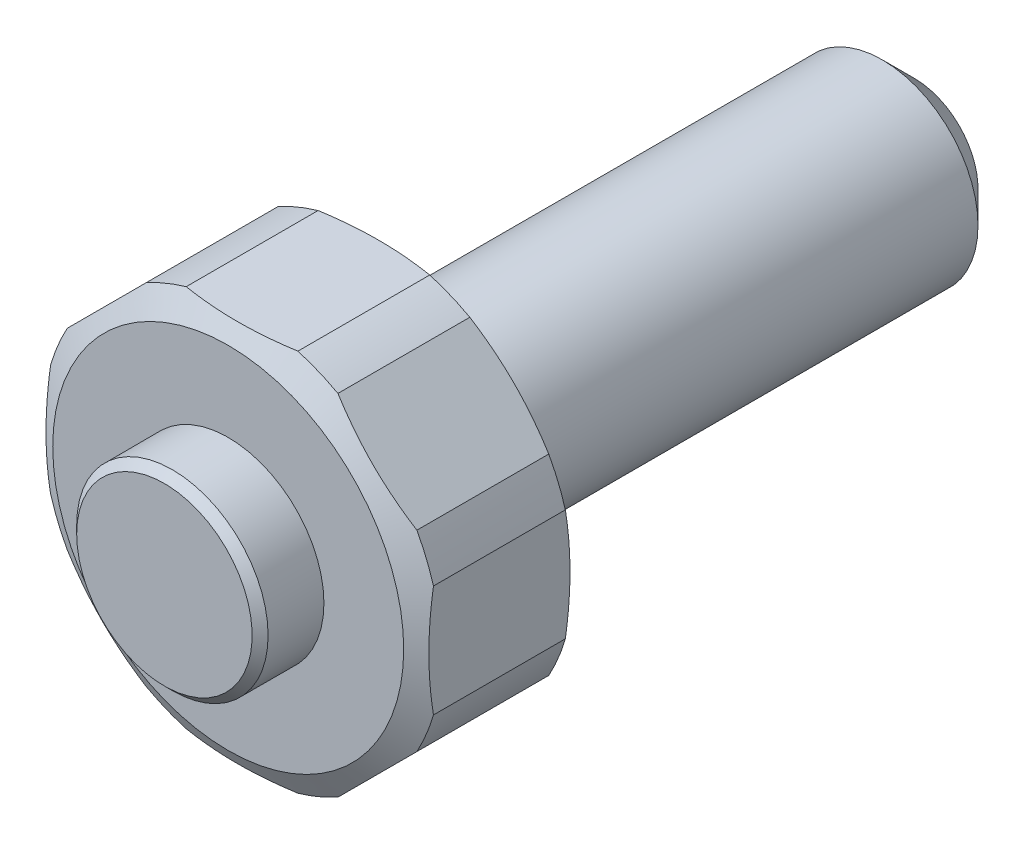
ISO-10303-21;
HEADER;
FILE_DESCRIPTION(('STEP AP214'),'2;1');
FILE_NAME('part.step','',(''),(''),'','','');
FILE_SCHEMA(('AUTOMOTIVE_DESIGN { 1 0 10303 214 1 1 1 1 }'));
ENDSEC;
DATA;
#1=APPLICATION_CONTEXT('core data for automotive mechanical design processes');
#2=APPLICATION_PROTOCOL_DEFINITION('international standard','automotive_design',2000,#1);
#3=PRODUCT_CONTEXT('',#1,'mechanical');
#4=PRODUCT('Part','Part','',(#3));
#5=PRODUCT_RELATED_PRODUCT_CATEGORY('part','',(#4));
#6=PRODUCT_DEFINITION_FORMATION('','',#4);
#7=PRODUCT_DEFINITION_CONTEXT('part definition',#1,'design');
#8=PRODUCT_DEFINITION('design','',#6,#7);
#9=PRODUCT_DEFINITION_SHAPE('','',#8);
#10=(LENGTH_UNIT() NAMED_UNIT(*) SI_UNIT(.MILLI.,.METRE.));
#11=(NAMED_UNIT(*) PLANE_ANGLE_UNIT() SI_UNIT($,.RADIAN.));
#12=(NAMED_UNIT(*) SI_UNIT($,.STERADIAN.) SOLID_ANGLE_UNIT());
#13=UNCERTAINTY_MEASURE_WITH_UNIT(LENGTH_MEASURE(1.E-05),#10,'distance_accuracy_value','');
#14=(GEOMETRIC_REPRESENTATION_CONTEXT(3) GLOBAL_UNCERTAINTY_ASSIGNED_CONTEXT((#13)) GLOBAL_UNIT_ASSIGNED_CONTEXT((#10,
#11,#12)) REPRESENTATION_CONTEXT('',''));
#15=CARTESIAN_POINT('',(0.,0.,0.));
#16=DIRECTION('',(0.,0.,1.));
#17=DIRECTION('',(1.,0.,0.));
#18=AXIS2_PLACEMENT_3D('',#15,#16,#17);
#19=CARTESIAN_POINT('',(0.,0.,22.));
#20=DIRECTION('',(0.,0.,1.));
#21=DIRECTION('',(1.,0.,0.));
#22=AXIS2_PLACEMENT_3D('',#19,#20,#21);
#23=CYLINDRICAL_SURFACE('',#22,6.);
#24=CARTESIAN_POINT('',(0.,0.,-31.));
#25=DIRECTION('',(0.,0.,-1.));
#26=DIRECTION('',(-1.,0.,0.));
#27=AXIS2_PLACEMENT_3D('',#24,#25,#26);
#28=CIRCLE('',#27,6.);
#29=CARTESIAN_POINT('',(-6.,0.,-31.));
#30=VERTEX_POINT('',#29);
#31=EDGE_CURVE('E9',#30,#30,#28,.F.);
#32=ORIENTED_EDGE('',*,*,#31,.T.);
#33=EDGE_LOOP('',(#32));
#34=FACE_BOUND('',#33,.T.);
#35=CARTESIAN_POINT('',(0.,0.,0.));
#36=DIRECTION('',(0.,0.,1.));
#37=DIRECTION('',(1.,0.,0.));
#38=AXIS2_PLACEMENT_3D('',#35,#36,#37);
#39=CIRCLE('',#38,6.);
#40=CARTESIAN_POINT('',(6.,0.,0.));
#41=VERTEX_POINT('',#40);
#42=EDGE_CURVE('E193',#41,#41,#39,.T.);
#43=ORIENTED_EDGE('',*,*,#42,.F.);
#44=EDGE_LOOP('',(#43));
#45=FACE_BOUND('',#44,.T.);
#46=ADVANCED_FACE('F14',(#34,#45),#23,.T.);
#47=CARTESIAN_POINT('',(6.,0.,0.));
#48=DIRECTION('',(0.,0.,1.));
#49=DIRECTION('',(1.,0.,0.));
#50=AXIS2_PLACEMENT_3D('',#47,#48,#49);
#51=PLANE('',#50);
#52=ORIENTED_EDGE('',*,*,#42,.T.);
#53=EDGE_LOOP('',(#52));
#54=FACE_BOUND('',#53,.T.);
#55=CARTESIAN_POINT('',(0.,0.,0.));
#56=DIRECTION('',(0.,0.,-1.));
#57=DIRECTION('',(-1.,0.,0.));
#58=AXIS2_PLACEMENT_3D('',#55,#56,#57);
#59=CIRCLE('',#58,11.);
#60=CARTESIAN_POINT('',(-11.,0.,0.));
#61=VERTEX_POINT('',#60);
#62=EDGE_CURVE('E550',#61,#61,#59,.T.);
#63=ORIENTED_EDGE('',*,*,#62,.T.);
#64=EDGE_LOOP('',(#63));
#65=FACE_BOUND('',#64,.T.);
#66=ADVANCED_FACE('F311',(#54,#65),#51,.F.);
#67=CARTESIAN_POINT('',(0.,0.,-58.));
#68=DIRECTION('',(0.,0.,-1.));
#69=DIRECTION('',(-1.,0.,0.));
#70=AXIS2_PLACEMENT_3D('',#67,#68,#69);
#71=CYLINDRICAL_SURFACE('',#70,12.5);
#72=CARTESIAN_POINT('',(0.,0.,9.13397459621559));
#73=DIRECTION('',(0.,0.,-1.));
#74=DIRECTION('',(-1.,0.,0.));
#75=AXIS2_PLACEMENT_3D('',#72,#73,#74);
#76=CIRCLE('',#75,12.5);
#77=CARTESIAN_POINT('',(3.5,-12.,9.13397459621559));
#78=VERTEX_POINT('',#77);
#79=CARTESIAN_POINT('',(6.01040764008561,-10.9601551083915,9.13397459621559));
#80=VERTEX_POINT('',#79);
#81=EDGE_CURVE('E608',#78,#80,#76,.F.);
#82=ORIENTED_EDGE('',*,*,#81,.F.);
#83=DIRECTION('',(0.,0.,-1.));
#84=VECTOR('',#83,1.);
#85=CARTESIAN_POINT('',(3.5,-12.,-58.));
#86=LINE('',#85,#84);
#87=CARTESIAN_POINT('',(3.5,-12.,0.866025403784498));
#88=VERTEX_POINT('',#87);
#89=EDGE_CURVE('E355',#78,#88,#86,.T.);
#90=ORIENTED_EDGE('',*,*,#89,.T.);
#91=CARTESIAN_POINT('',(0.,0.,0.866025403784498));
#92=DIRECTION('',(0.,0.,1.));
#93=DIRECTION('',(1.,0.,0.));
#94=AXIS2_PLACEMENT_3D('',#91,#92,#93);
#95=CIRCLE('',#94,12.5);
#96=CARTESIAN_POINT('',(6.01040764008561,-10.9601551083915,0.866025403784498));
#97=VERTEX_POINT('',#96);
#98=EDGE_CURVE('E593',#97,#88,#95,.F.);
#99=ORIENTED_EDGE('',*,*,#98,.F.);
#100=DIRECTION('',(0.,0.,-1.));
#101=VECTOR('',#100,1.);
#102=CARTESIAN_POINT('',(6.01040764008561,-10.9601551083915,-58.));
#103=LINE('',#102,#101);
#104=EDGE_CURVE('E187',#80,#97,#103,.T.);
#105=ORIENTED_EDGE('',*,*,#104,.F.);
#106=EDGE_LOOP('',(#82,#90,#99,#105));
#107=FACE_BOUND('',#106,.T.);
#108=ADVANCED_FACE('F307',(#107),#71,.T.);
#109=CARTESIAN_POINT('',(12.,-3.5,0.866025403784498));
#110=VERTEX_POINT('',#109);
#111=CARTESIAN_POINT('',(10.9601551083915,-6.01040764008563,0.866025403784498));
#112=VERTEX_POINT('',#111);
#113=EDGE_CURVE('E29',#110,#112,#95,.F.);
#114=ORIENTED_EDGE('',*,*,#113,.F.);
#115=DIRECTION('',(0.,0.,-1.));
#116=VECTOR('',#115,1.);
#117=CARTESIAN_POINT('',(12.,-3.5,-58.));
#118=LINE('',#117,#116);
#119=CARTESIAN_POINT('',(12.,-3.5,9.13397459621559));
#120=VERTEX_POINT('',#119);
#121=EDGE_CURVE('E181',#120,#110,#118,.T.);
#122=ORIENTED_EDGE('',*,*,#121,.F.);
#123=CARTESIAN_POINT('',(10.9601551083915,-6.01040764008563,9.13397459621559));
#124=VERTEX_POINT('',#123);
#125=EDGE_CURVE('E606',#124,#120,#76,.F.);
#126=ORIENTED_EDGE('',*,*,#125,.F.);
#127=DIRECTION('',(0.,0.,-1.));
#128=VECTOR('',#127,1.);
#129=CARTESIAN_POINT('',(10.9601551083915,-6.01040764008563,-58.));
#130=LINE('',#129,#128);
#131=EDGE_CURVE('E184',#112,#124,#130,.F.);
#132=ORIENTED_EDGE('',*,*,#131,.F.);
#133=EDGE_LOOP('',(#114,#122,#126,#132));
#134=FACE_BOUND('',#133,.T.);
#135=ADVANCED_FACE('F310',(#134),#71,.T.);
#136=CARTESIAN_POINT('',(10.9601551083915,6.01040764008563,0.866025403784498));
#137=VERTEX_POINT('',#136);
#138=CARTESIAN_POINT('',(12.,3.5,0.866025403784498));
#139=VERTEX_POINT('',#138);
#140=EDGE_CURVE('E35',#137,#139,#95,.F.);
#141=ORIENTED_EDGE('',*,*,#140,.F.);
#142=DIRECTION('',(0.,0.,-1.));
#143=VECTOR('',#142,1.);
#144=CARTESIAN_POINT('',(10.9601551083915,6.01040764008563,-58.));
#145=LINE('',#144,#143);
#146=CARTESIAN_POINT('',(10.9601551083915,6.01040764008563,9.13397459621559));
#147=VERTEX_POINT('',#146);
#148=EDGE_CURVE('E175',#147,#137,#145,.T.);
#149=ORIENTED_EDGE('',*,*,#148,.F.);
#150=CARTESIAN_POINT('',(12.,3.5,9.13397459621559));
#151=VERTEX_POINT('',#150);
#152=EDGE_CURVE('E605',#151,#147,#76,.F.);
#153=ORIENTED_EDGE('',*,*,#152,.F.);
#154=DIRECTION('',(0.,0.,-1.));
#155=VECTOR('',#154,1.);
#156=CARTESIAN_POINT('',(12.,3.5,-58.));
#157=LINE('',#156,#155);
#158=EDGE_CURVE('E178',#139,#151,#157,.F.);
#159=ORIENTED_EDGE('',*,*,#158,.F.);
#160=EDGE_LOOP('',(#141,#149,#153,#159));
#161=FACE_BOUND('',#160,.T.);
#162=ADVANCED_FACE('F319',(#161),#71,.T.);
#163=CARTESIAN_POINT('',(3.5,12.,0.866025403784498));
#164=VERTEX_POINT('',#163);
#165=CARTESIAN_POINT('',(6.01040764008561,10.9601551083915,0.866025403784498));
#166=VERTEX_POINT('',#165);
#167=EDGE_CURVE('E549',#164,#166,#95,.F.);
#168=ORIENTED_EDGE('',*,*,#167,.F.);
#169=DIRECTION('',(0.,0.,-1.));
#170=VECTOR('',#169,1.);
#171=CARTESIAN_POINT('',(3.5,12.,-58.));
#172=LINE('',#171,#170);
#173=CARTESIAN_POINT('',(3.5,12.,9.13397459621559));
#174=VERTEX_POINT('',#173);
#175=EDGE_CURVE('E169',#174,#164,#172,.T.);
#176=ORIENTED_EDGE('',*,*,#175,.F.);
#177=CARTESIAN_POINT('',(6.01040764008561,10.9601551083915,9.13397459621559));
#178=VERTEX_POINT('',#177);
#179=EDGE_CURVE('E603',#178,#174,#76,.F.);
#180=ORIENTED_EDGE('',*,*,#179,.F.);
#181=DIRECTION('',(0.,0.,-1.));
#182=VECTOR('',#181,1.);
#183=CARTESIAN_POINT('',(6.01040764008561,10.9601551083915,-58.));
#184=LINE('',#183,#182);
#185=EDGE_CURVE('E172',#166,#178,#184,.F.);
#186=ORIENTED_EDGE('',*,*,#185,.F.);
#187=EDGE_LOOP('',(#168,#176,#180,#186));
#188=FACE_BOUND('',#187,.T.);
#189=ADVANCED_FACE('F493',(#188),#71,.T.);
#190=CARTESIAN_POINT('',(-6.0104076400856,10.9601551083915,0.866025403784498));
#191=VERTEX_POINT('',#190);
#192=CARTESIAN_POINT('',(-3.5,12.,0.866025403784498));
#193=VERTEX_POINT('',#192);
#194=EDGE_CURVE('E628',#191,#193,#95,.F.);
#195=ORIENTED_EDGE('',*,*,#194,.F.);
#196=DIRECTION('',(0.,0.,-1.));
#197=VECTOR('',#196,1.);
#198=CARTESIAN_POINT('',(-6.01040764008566,10.9601551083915,-58.));
#199=LINE('',#198,#197);
#200=CARTESIAN_POINT('',(-6.0104076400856,10.9601551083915,9.13397459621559));
#201=VERTEX_POINT('',#200);
#202=EDGE_CURVE('E158',#201,#191,#199,.T.);
#203=ORIENTED_EDGE('',*,*,#202,.F.);
#204=CARTESIAN_POINT('',(-3.5,12.,9.13397459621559));
#205=VERTEX_POINT('',#204);
#206=EDGE_CURVE('E602',#205,#201,#76,.F.);
#207=ORIENTED_EDGE('',*,*,#206,.F.);
#208=DIRECTION('',(0.,0.,-1.));
#209=VECTOR('',#208,1.);
#210=CARTESIAN_POINT('',(-3.5,12.,-58.));
#211=LINE('',#210,#209);
#212=EDGE_CURVE('E166',#193,#205,#211,.F.);
#213=ORIENTED_EDGE('',*,*,#212,.F.);
#214=EDGE_LOOP('',(#195,#203,#207,#213));
#215=FACE_BOUND('',#214,.T.);
#216=ADVANCED_FACE('F486',(#215),#71,.T.);
#217=DIRECTION('',(0.,0.,-1.));
#218=VECTOR('',#217,1.);
#219=CARTESIAN_POINT('',(-12.,-3.5,-58.));
#220=LINE('',#219,#218);
#221=CARTESIAN_POINT('',(-12.,-3.5,9.13397459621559));
#222=VERTEX_POINT('',#221);
#223=CARTESIAN_POINT('',(-12.,-3.5,0.866025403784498));
#224=VERTEX_POINT('',#223);
#225=EDGE_CURVE('E145',#222,#224,#220,.T.);
#226=ORIENTED_EDGE('',*,*,#225,.T.);
#227=CARTESIAN_POINT('',(-10.9601551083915,-6.01040764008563,0.866025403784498));
#228=VERTEX_POINT('',#227);
#229=EDGE_CURVE('E633',#228,#224,#95,.F.);
#230=ORIENTED_EDGE('',*,*,#229,.F.);
#231=DIRECTION('',(0.,0.,-1.));
#232=VECTOR('',#231,1.);
#233=CARTESIAN_POINT('',(-10.9601551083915,-6.01040764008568,-58.));
#234=LINE('',#233,#232);
#235=CARTESIAN_POINT('',(-10.9601551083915,-6.01040764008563,9.13397459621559));
#236=VERTEX_POINT('',#235);
#237=EDGE_CURVE('E148',#228,#236,#234,.F.);
#238=ORIENTED_EDGE('',*,*,#237,.T.);
#239=EDGE_CURVE('E131',#222,#236,#76,.F.);
#240=ORIENTED_EDGE('',*,*,#239,.F.);
#241=EDGE_LOOP('',(#226,#230,#238,#240));
#242=FACE_BOUND('',#241,.T.);
#243=ADVANCED_FACE('F143',(#242),#71,.T.);
#244=CARTESIAN_POINT('',(-12.,3.5,0.866025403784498));
#245=VERTEX_POINT('',#244);
#246=CARTESIAN_POINT('',(-10.9601551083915,6.0104076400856,0.866025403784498));
#247=VERTEX_POINT('',#246);
#248=EDGE_CURVE('E632',#245,#247,#95,.F.);
#249=ORIENTED_EDGE('',*,*,#248,.F.);
#250=DIRECTION('',(0.,0.,-1.));
#251=VECTOR('',#250,1.);
#252=CARTESIAN_POINT('',(-12.,3.5,-58.));
#253=LINE('',#252,#251);
#254=CARTESIAN_POINT('',(-12.,3.5,9.13397459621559));
#255=VERTEX_POINT('',#254);
#256=EDGE_CURVE('E155',#245,#255,#253,.F.);
#257=ORIENTED_EDGE('',*,*,#256,.T.);
#258=CARTESIAN_POINT('',(-10.9601551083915,6.0104076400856,9.13397459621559));
#259=VERTEX_POINT('',#258);
#260=EDGE_CURVE('E134',#259,#255,#76,.F.);
#261=ORIENTED_EDGE('',*,*,#260,.F.);
#262=DIRECTION('',(0.,0.,-1.));
#263=VECTOR('',#262,1.);
#264=CARTESIAN_POINT('',(-10.9601551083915,6.01040764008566,-58.));
#265=LINE('',#264,#263);
#266=EDGE_CURVE('E154',#247,#259,#265,.F.);
#267=ORIENTED_EDGE('',*,*,#266,.F.);
#268=EDGE_LOOP('',(#249,#257,#261,#267));
#269=FACE_BOUND('',#268,.T.);
#270=ADVANCED_FACE('F325',(#269),#71,.T.);
#271=DIRECTION('',(0.,0.,-1.));
#272=VECTOR('',#271,1.);
#273=CARTESIAN_POINT('',(-6.01040764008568,-10.9601551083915,-58.));
#274=LINE('',#273,#272);
#275=CARTESIAN_POINT('',(-6.01040764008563,-10.9601551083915,9.13397459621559));
#276=VERTEX_POINT('',#275);
#277=CARTESIAN_POINT('',(-6.01040764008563,-10.9601551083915,0.866025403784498));
#278=VERTEX_POINT('',#277);
#279=EDGE_CURVE('E160',#276,#278,#274,.T.);
#280=ORIENTED_EDGE('',*,*,#279,.T.);
#281=CARTESIAN_POINT('',(-3.5,-12.,0.866025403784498));
#282=VERTEX_POINT('',#281);
#283=EDGE_CURVE('E623',#282,#278,#95,.F.);
#284=ORIENTED_EDGE('',*,*,#283,.F.);
#285=DIRECTION('',(0.,0.,-1.));
#286=VECTOR('',#285,1.);
#287=CARTESIAN_POINT('',(-3.5,-12.,-58.));
#288=LINE('',#287,#286);
#289=CARTESIAN_POINT('',(-3.5,-12.,9.13397459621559));
#290=VERTEX_POINT('',#289);
#291=EDGE_CURVE('E205',#282,#290,#288,.F.);
#292=ORIENTED_EDGE('',*,*,#291,.T.);
#293=EDGE_CURVE('E150',#276,#290,#76,.F.);
#294=ORIENTED_EDGE('',*,*,#293,.F.);
#295=EDGE_LOOP('',(#280,#284,#292,#294));
#296=FACE_BOUND('',#295,.T.);
#297=ADVANCED_FACE('F216',(#296),#71,.T.);
#298=CARTESIAN_POINT('',(0.,0.,2.5495315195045));
#299=DIRECTION('',(0.,0.,1.));
#300=DIRECTION('',(1.,0.,0.));
#301=AXIS2_PLACEMENT_3D('',#298,#299,#300);
#302=CONICAL_SURFACE('',#301,15.4159181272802,1.0471975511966);
#303=CARTESIAN_POINT('',(10.9610297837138,-6.00953296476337,0.8662254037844));
#304=CARTESIAN_POINT('',(10.7557968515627,-6.21476589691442,0.819258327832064));
#305=CARTESIAN_POINT('',(10.5499383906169,-6.42062435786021,0.77758722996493));
#306=CARTESIAN_POINT('',(10.137202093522,-6.83336065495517,0.70550975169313));
#307=CARTESIAN_POINT('',(9.93032407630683,-7.04023867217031,0.67510545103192));
#308=CARTESIAN_POINT('',(9.51725429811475,-7.45330845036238,0.62641694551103));
#309=CARTESIAN_POINT('',(9.31106732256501,-7.65949542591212,0.608052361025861));
#310=CARTESIAN_POINT('',(8.89834733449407,-8.07221541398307,0.583519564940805));
#311=CARTESIAN_POINT('',(8.69181435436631,-8.27874839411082,0.577350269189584));
#312=CARTESIAN_POINT('',(8.2787483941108,-8.69181435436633,0.577350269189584));
#313=CARTESIAN_POINT('',(8.07221541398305,-8.89834733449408,0.583519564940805));
#314=CARTESIAN_POINT('',(7.65949542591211,-9.31106732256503,0.608052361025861));
#315=CARTESIAN_POINT('',(7.45330845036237,-9.51725429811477,0.62641694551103));
#316=CARTESIAN_POINT('',(7.04023867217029,-9.93032407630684,0.67510545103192));
#317=CARTESIAN_POINT('',(6.83336065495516,-10.137202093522,0.705509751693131));
#318=CARTESIAN_POINT('',(6.42062435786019,-10.5499383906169,0.777587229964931));
#319=CARTESIAN_POINT('',(6.21476589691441,-10.7557968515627,0.819258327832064));
#320=CARTESIAN_POINT('',(6.00953296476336,-10.9610297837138,0.8662254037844));
#321=B_SPLINE_CURVE_WITH_KNOTS('',3,(#303,#304,#305,#306,#307,#308,#309,#310,#311,#312,#313,
#314,#315,#316,#317,#318,#319,#320),.UNSPECIFIED.,.F.,.F.,(4,2,2,2,2,2,2,2,4),(0.,
0.88204821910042,1.76425917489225,2.64051865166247,3.51670022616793,4.39288180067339,
5.2691412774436,6.15135223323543,7.03340045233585),.UNSPECIFIED.);
#322=EDGE_CURVE('E269',#112,#97,#321,.T.);
#323=ORIENTED_EDGE('',*,*,#322,.T.);
#324=ORIENTED_EDGE('',*,*,#98,.T.);
#325=CARTESIAN_POINT('',(-14.9188294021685,-12.,4.7031277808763));
#326=CARTESIAN_POINT('',(-14.6919138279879,-12.,4.60104600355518));
#327=CARTESIAN_POINT('',(-14.464658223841,-12.,4.49972066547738));
#328=CARTESIAN_POINT('',(-14.0094029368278,-12.,4.29874518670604));
#329=CARTESIAN_POINT('',(-13.7814032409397,-12.,4.19909507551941));
#330=CARTESIAN_POINT('',(-13.0961002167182,-12.,3.90286156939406));
#331=CARTESIAN_POINT('',(-12.6375959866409,-12.,3.70904152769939));
#332=CARTESIAN_POINT('',(-11.714140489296,-12.,3.32928856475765));
#333=CARTESIAN_POINT('',(-11.2491671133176,-12.,3.14340924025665));
#334=CARTESIAN_POINT('',(-10.3148928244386,-12.,2.78289851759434));
#335=CARTESIAN_POINT('',(-9.84559219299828,-12.,2.60826639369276));
#336=CARTESIAN_POINT('',(-8.90705094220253,-12.,2.27469533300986));
#337=CARTESIAN_POINT('',(-8.43786305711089,-12.,2.115608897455));
#338=CARTESIAN_POINT('',(-7.49403784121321,-12.,1.81423618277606));
#339=CARTESIAN_POINT('',(-7.01940010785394,-12.,1.67195115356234));
#340=CARTESIAN_POINT('',(-6.06542424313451,-12.,1.40832238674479));
#341=CARTESIAN_POINT('',(-5.58609883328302,-12.,1.28693301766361));
#342=CARTESIAN_POINT('',(-4.6218358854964,-12.,1.06904936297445));
#343=CARTESIAN_POINT('',(-4.1368997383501,-12.,0.97254904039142));
#344=CARTESIAN_POINT('',(-3.36893010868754,-12.,0.843532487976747));
#345=CARTESIAN_POINT('',(-3.08752263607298,-12.,0.801239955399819));
#346=CARTESIAN_POINT('',(-2.52334358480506,-12.,0.727090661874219));
#347=CARTESIAN_POINT('',(-2.24057211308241,-12.,0.695233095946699));
#348=CARTESIAN_POINT('',(-1.6739517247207,-12.,0.642570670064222));
#349=CARTESIAN_POINT('',(-1.39010264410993,-12.,0.621767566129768));
#350=CARTESIAN_POINT('',(-0.821788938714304,-12.,0.591655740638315));
#351=CARTESIAN_POINT('',(-0.537324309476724,-12.,0.582347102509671));
#352=CARTESIAN_POINT('',(0.0320250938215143,-12.,0.575424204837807));
#353=CARTESIAN_POINT('',(0.316910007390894,-12.,0.577821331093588));
#354=CARTESIAN_POINT('',(0.88633713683,-12.,0.594282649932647));
#355=CARTESIAN_POINT('',(1.17087935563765,-12.,0.608346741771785));
#356=CARTESIAN_POINT('',(1.73908078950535,-12.,0.647834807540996));
#357=CARTESIAN_POINT('',(2.02274025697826,-12.,0.673255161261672));
#358=CARTESIAN_POINT('',(2.58888865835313,-12.,0.734930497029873));
#359=CARTESIAN_POINT('',(2.87137747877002,-12.,0.771186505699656));
#360=CARTESIAN_POINT('',(3.7468065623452,-12.,0.899648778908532));
#361=CARTESIAN_POINT('',(4.33722942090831,-12.,1.00936119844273));
#362=CARTESIAN_POINT('',(5.5098985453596,-12.,1.26631503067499));
#363=CARTESIAN_POINT('',(6.09214074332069,-12.,1.4135744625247));
#364=CARTESIAN_POINT('',(7.25041645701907,-12.,1.73846605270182));
#365=CARTESIAN_POINT('',(7.82641718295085,-12.,1.91621366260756));
#366=CARTESIAN_POINT('',(8.97053682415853,-12.,2.29497159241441));
#367=CARTESIAN_POINT('',(9.53865683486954,-12.,2.49597864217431));
#368=CARTESIAN_POINT('',(10.6748965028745,-12.,2.91849340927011));
#369=CARTESIAN_POINT('',(11.2429352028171,-12.,3.14021720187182));
#370=CARTESIAN_POINT('',(12.3732525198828,-12.,3.59793560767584));
#371=CARTESIAN_POINT('',(12.9355306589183,-12.,3.83393139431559));
#372=CARTESIAN_POINT('',(14.0498267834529,-12.,4.3146984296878));
#373=CARTESIAN_POINT('',(14.6018913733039,-12.,4.55936206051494));
#374=CARTESIAN_POINT('',(15.4269629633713,-12.,4.93279527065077));
#375=CARTESIAN_POINT('',(15.7014431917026,-12.,5.05832737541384));
#376=CARTESIAN_POINT('',(16.2495039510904,-12.,5.31132718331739));
#377=CARTESIAN_POINT('',(16.5230844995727,-12.,5.43879484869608));
#378=CARTESIAN_POINT('',(16.7962614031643,-12.,5.5671222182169));
#379=B_SPLINE_CURVE_WITH_KNOTS('',3,(#325,#326,#327,#328,#329,#330,#331,#332,#333,#334,#335,
#336,#337,#338,#339,#340,#341,#342,#343,#344,#345,#346,#347,#348,#349,#350,#351,#352,#353,#354,
#355,#356,#357,#358,#359,#360,#361,#362,#363,#364,#365,#366,#367,#368,#369,#370,#371,#372,#373,
#374,#375,#376,#377,#378),.UNSPECIFIED.,.F.,.F.,(4,2,2,2,2,2,2,2,2,2,2,2,2,2,2,2,2,2,2,2,2,2,2,
2,2,2,4),(0.,0.746457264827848,1.49292766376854,2.98620758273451,4.48834418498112,
5.99038376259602,7.47640484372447,8.96253640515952,10.4453802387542,11.9278640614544,
12.7814006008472,13.6348712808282,14.4884774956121,15.3420899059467,16.1965327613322,
17.0509682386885,17.905131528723,18.7593757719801,20.5592996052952,22.3600888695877,
24.1678542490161,25.9753657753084,27.8044536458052,29.633692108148,31.4451470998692,
32.3506131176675,33.2560614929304),.UNSPECIFIED.);
#380=EDGE_CURVE('E196',#282,#88,#379,.T.);
#381=ORIENTED_EDGE('',*,*,#380,.F.);
#382=ORIENTED_EDGE('',*,*,#283,.T.);
#383=CARTESIAN_POINT('',(-10.9610297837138,-6.00953296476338,0.8662254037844));
#384=CARTESIAN_POINT('',(-10.7557968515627,-6.21476589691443,0.819258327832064));
#385=CARTESIAN_POINT('',(-10.5499383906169,-6.42062435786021,0.77758722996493));
#386=CARTESIAN_POINT('',(-10.137202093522,-6.83336065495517,0.70550975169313));
#387=CARTESIAN_POINT('',(-9.93032407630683,-7.04023867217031,0.67510545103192));
#388=CARTESIAN_POINT('',(-9.51725429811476,-7.45330845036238,0.626416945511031));
#389=CARTESIAN_POINT('',(-9.31106732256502,-7.65949542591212,0.608052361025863));
#390=CARTESIAN_POINT('',(-8.89834733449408,-8.07221541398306,0.583519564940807));
#391=CARTESIAN_POINT('',(-8.69181435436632,-8.27874839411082,0.577350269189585));
#392=CARTESIAN_POINT('',(-8.27874839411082,-8.69181435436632,0.577350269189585));
#393=CARTESIAN_POINT('',(-8.07221541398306,-8.89834733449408,0.583519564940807));
#394=CARTESIAN_POINT('',(-7.65949542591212,-9.31106732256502,0.608052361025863));
#395=CARTESIAN_POINT('',(-7.45330845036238,-9.51725429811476,0.626416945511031));
#396=CARTESIAN_POINT('',(-7.04023867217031,-9.93032407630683,0.67510545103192));
#397=CARTESIAN_POINT('',(-6.83336065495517,-10.137202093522,0.705509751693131));
#398=CARTESIAN_POINT('',(-6.42062435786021,-10.5499383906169,0.777587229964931));
#399=CARTESIAN_POINT('',(-6.21476589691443,-10.7557968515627,0.819258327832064));
#400=CARTESIAN_POINT('',(-6.00953296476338,-10.9610297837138,0.8662254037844));
#401=B_SPLINE_CURVE_WITH_KNOTS('',3,(#383,#384,#385,#386,#387,#388,#389,#390,#391,#392,#393,
#394,#395,#396,#397,#398,#399,#400),.UNSPECIFIED.,.F.,.F.,(4,2,2,2,2,2,2,2,4),(0.,
0.882048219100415,1.76425917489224,2.64051865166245,3.51670022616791,4.39288180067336,
5.26914127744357,6.1513522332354,7.03340045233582),.UNSPECIFIED.);
#402=EDGE_CURVE('E226',#228,#278,#401,.T.);
#403=ORIENTED_EDGE('',*,*,#402,.F.);
#404=ORIENTED_EDGE('',*,*,#229,.T.);
#405=CARTESIAN_POINT('',(-12.,-14.9188294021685,4.7031277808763));
#406=CARTESIAN_POINT('',(-12.,-14.6919138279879,4.60104600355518));
#407=CARTESIAN_POINT('',(-12.,-14.464658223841,4.49972066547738));
#408=CARTESIAN_POINT('',(-12.,-14.0094029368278,4.29874518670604));
#409=CARTESIAN_POINT('',(-12.,-13.7814032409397,4.19909507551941));
#410=CARTESIAN_POINT('',(-12.,-13.0961002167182,3.90286156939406));
#411=CARTESIAN_POINT('',(-12.,-12.6375959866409,3.70904152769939));
#412=CARTESIAN_POINT('',(-12.,-11.714140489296,3.32928856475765));
#413=CARTESIAN_POINT('',(-12.,-11.2491671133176,3.14340924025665));
#414=CARTESIAN_POINT('',(-12.,-10.3148928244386,2.78289851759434));
#415=CARTESIAN_POINT('',(-12.,-9.84559219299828,2.60826639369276));
#416=CARTESIAN_POINT('',(-12.,-8.90705094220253,2.27469533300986));
#417=CARTESIAN_POINT('',(-12.,-8.43786305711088,2.11560889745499));
#418=CARTESIAN_POINT('',(-12.,-7.49403784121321,1.81423618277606));
#419=CARTESIAN_POINT('',(-12.,-7.01940010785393,1.67195115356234));
#420=CARTESIAN_POINT('',(-12.,-6.06542424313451,1.40832238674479));
#421=CARTESIAN_POINT('',(-12.,-5.58609883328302,1.2869330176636));
#422=CARTESIAN_POINT('',(-12.,-4.6218358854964,1.06904936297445));
#423=CARTESIAN_POINT('',(-12.,-4.1368997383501,0.97254904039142));
#424=CARTESIAN_POINT('',(-12.,-3.36893010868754,0.843532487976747));
#425=CARTESIAN_POINT('',(-12.,-3.08752263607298,0.801239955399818));
#426=CARTESIAN_POINT('',(-12.,-2.52334358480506,0.727090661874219));
#427=CARTESIAN_POINT('',(-12.,-2.24057211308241,0.695233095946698));
#428=CARTESIAN_POINT('',(-12.,-1.6739517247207,0.642570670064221));
#429=CARTESIAN_POINT('',(-12.,-1.39010264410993,0.621767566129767));
#430=CARTESIAN_POINT('',(-12.,-0.821788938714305,0.591655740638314));
#431=CARTESIAN_POINT('',(-12.,-0.537324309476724,0.582347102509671));
#432=CARTESIAN_POINT('',(-12.,0.0320250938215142,0.575424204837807));
#433=CARTESIAN_POINT('',(-12.,0.316910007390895,0.577821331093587));
#434=CARTESIAN_POINT('',(-12.,0.886337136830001,0.594282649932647));
#435=CARTESIAN_POINT('',(-12.,1.17087935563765,0.608346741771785));
#436=CARTESIAN_POINT('',(-12.,1.73908078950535,0.647834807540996));
#437=CARTESIAN_POINT('',(-12.,2.02274025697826,0.673255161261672));
#438=CARTESIAN_POINT('',(-12.,2.58888865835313,0.734930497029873));
#439=CARTESIAN_POINT('',(-12.,2.87137747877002,0.771186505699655));
#440=CARTESIAN_POINT('',(-12.,3.7468065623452,0.899648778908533));
#441=CARTESIAN_POINT('',(-12.,4.33722942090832,1.00936119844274));
#442=CARTESIAN_POINT('',(-12.,5.50989854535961,1.26631503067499));
#443=CARTESIAN_POINT('',(-12.,6.0921407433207,1.41357446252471));
#444=CARTESIAN_POINT('',(-12.,7.25041645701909,1.73846605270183));
#445=CARTESIAN_POINT('',(-12.,7.82641718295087,1.91621366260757));
#446=CARTESIAN_POINT('',(-12.,8.97053682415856,2.29497159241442));
#447=CARTESIAN_POINT('',(-12.,9.53865683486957,2.49597864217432));
#448=CARTESIAN_POINT('',(-12.,10.6748965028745,2.91849340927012));
#449=CARTESIAN_POINT('',(-12.,11.2429352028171,3.14021720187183));
#450=CARTESIAN_POINT('',(-12.,12.3732525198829,3.59793560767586));
#451=CARTESIAN_POINT('',(-12.,12.9355306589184,3.8339313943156));
#452=CARTESIAN_POINT('',(-12.,14.0498267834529,4.31469842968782));
#453=CARTESIAN_POINT('',(-12.,14.6018913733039,4.55936206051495));
#454=CARTESIAN_POINT('',(-12.,15.4269629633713,4.93279527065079));
#455=CARTESIAN_POINT('',(-12.,15.7014431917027,5.05832737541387));
#456=CARTESIAN_POINT('',(-12.,16.2495039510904,5.31132718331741));
#457=CARTESIAN_POINT('',(-12.,16.5230844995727,5.4387948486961));
#458=CARTESIAN_POINT('',(-12.,16.7962614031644,5.5671222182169));
#459=B_SPLINE_CURVE_WITH_KNOTS('',3,(#405,#406,#407,#408,#409,#410,#411,#412,#413,#414,#415,
#416,#417,#418,#419,#420,#421,#422,#423,#424,#425,#426,#427,#428,#429,#430,#431,#432,#433,#434,
#435,#436,#437,#438,#439,#440,#441,#442,#443,#444,#445,#446,#447,#448,#449,#450,#451,#452,#453,
#454,#455,#456,#457,#458),.UNSPECIFIED.,.F.,.F.,(4,2,2,2,2,2,2,2,2,2,2,2,2,2,2,2,2,2,2,2,2,2,2,
2,2,2,4),(0.,0.746457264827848,1.49292766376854,2.98620758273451,4.48834418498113,
5.99038376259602,7.47640484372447,8.96253640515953,10.4453802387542,11.9278640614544,
12.7814006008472,13.6348712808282,14.4884774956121,15.3420899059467,16.1965327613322,
17.0509682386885,17.905131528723,18.7593757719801,20.5592996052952,22.3600888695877,
24.1678542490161,25.9753657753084,27.8044536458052,29.633692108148,31.4451470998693,
32.3506131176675,33.2560614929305),.UNSPECIFIED.);
#460=EDGE_CURVE('E153',#245,#224,#459,.F.);
#461=ORIENTED_EDGE('',*,*,#460,.F.);
#462=ORIENTED_EDGE('',*,*,#248,.T.);
#463=CARTESIAN_POINT('',(-10.9610297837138,6.00953296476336,0.8662254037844));
#464=CARTESIAN_POINT('',(-10.7557968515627,6.21476589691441,0.819258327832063));
#465=CARTESIAN_POINT('',(-10.5499383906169,6.42062435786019,0.77758722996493));
#466=CARTESIAN_POINT('',(-10.137202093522,6.83336065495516,0.705509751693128));
#467=CARTESIAN_POINT('',(-9.93032407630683,7.0402386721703,0.675105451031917));
#468=CARTESIAN_POINT('',(-9.51725429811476,7.45330845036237,0.626416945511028));
#469=CARTESIAN_POINT('',(-9.31106732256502,7.65949542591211,0.60805236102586));
#470=CARTESIAN_POINT('',(-8.89834733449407,8.07221541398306,0.583519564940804));
#471=CARTESIAN_POINT('',(-8.69181435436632,8.27874839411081,0.577350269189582));
#472=CARTESIAN_POINT('',(-8.27874839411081,8.69181435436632,0.577350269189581));
#473=CARTESIAN_POINT('',(-8.07221541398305,8.89834733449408,0.583519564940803));
#474=CARTESIAN_POINT('',(-7.65949542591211,9.31106732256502,0.608052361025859));
#475=CARTESIAN_POINT('',(-7.45330845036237,9.51725429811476,0.626416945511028));
#476=CARTESIAN_POINT('',(-7.04023867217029,9.93032407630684,0.675105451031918));
#477=CARTESIAN_POINT('',(-6.83336065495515,10.137202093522,0.705509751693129));
#478=CARTESIAN_POINT('',(-6.42062435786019,10.5499383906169,0.77758722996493));
#479=CARTESIAN_POINT('',(-6.2147658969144,10.7557968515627,0.819258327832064));
#480=CARTESIAN_POINT('',(-6.00953296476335,10.9610297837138,0.8662254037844));
#481=B_SPLINE_CURVE_WITH_KNOTS('',3,(#463,#464,#465,#466,#467,#468,#469,#470,#471,#472,#473,
#474,#475,#476,#477,#478,#479,#480),.UNSPECIFIED.,.F.,.F.,(4,2,2,2,2,2,2,2,4),(0.,
0.882048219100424,1.76425917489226,2.64051865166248,3.51670022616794,4.3928818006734,
5.26914127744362,6.15135223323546,7.03340045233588),.UNSPECIFIED.);
#482=EDGE_CURVE('E241',#247,#191,#481,.T.);
#483=ORIENTED_EDGE('',*,*,#482,.T.);
#484=ORIENTED_EDGE('',*,*,#194,.T.);
#485=CARTESIAN_POINT('',(-14.9188294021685,12.,4.7031277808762));
#486=CARTESIAN_POINT('',(-14.6919138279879,12.,4.60104600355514));
#487=CARTESIAN_POINT('',(-14.4646582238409,12.,4.49972066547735));
#488=CARTESIAN_POINT('',(-14.0094029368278,12.,4.29874518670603));
#489=CARTESIAN_POINT('',(-13.7814032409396,12.,4.1990950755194));
#490=CARTESIAN_POINT('',(-13.0961002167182,12.,3.90286156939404));
#491=CARTESIAN_POINT('',(-12.6375959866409,12.,3.70904152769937));
#492=CARTESIAN_POINT('',(-11.714140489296,12.,3.32928856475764));
#493=CARTESIAN_POINT('',(-11.2491671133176,12.,3.14340924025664));
#494=CARTESIAN_POINT('',(-10.3148928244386,12.,2.78289851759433));
#495=CARTESIAN_POINT('',(-9.84559219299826,12.,2.60826639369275));
#496=CARTESIAN_POINT('',(-8.9070509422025,12.,2.27469533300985));
#497=CARTESIAN_POINT('',(-8.43786305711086,12.,2.11560889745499));
#498=CARTESIAN_POINT('',(-7.49403784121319,12.,1.81423618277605));
#499=CARTESIAN_POINT('',(-7.01940010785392,12.,1.67195115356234));
#500=CARTESIAN_POINT('',(-6.06542424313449,12.,1.40832238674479));
#501=CARTESIAN_POINT('',(-5.586098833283,12.,1.2869330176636));
#502=CARTESIAN_POINT('',(-4.62183588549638,12.,1.06904936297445));
#503=CARTESIAN_POINT('',(-4.13689973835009,12.,0.972549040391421));
#504=CARTESIAN_POINT('',(-3.36893010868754,12.,0.843532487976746));
#505=CARTESIAN_POINT('',(-3.08752263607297,12.,0.801239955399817));
#506=CARTESIAN_POINT('',(-2.52334358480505,12.,0.727090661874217));
#507=CARTESIAN_POINT('',(-2.2405721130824,12.,0.695233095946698));
#508=CARTESIAN_POINT('',(-1.67395172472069,12.,0.642570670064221));
#509=CARTESIAN_POINT('',(-1.39010264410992,12.,0.621767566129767));
#510=CARTESIAN_POINT('',(-0.821788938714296,12.,0.591655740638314));
#511=CARTESIAN_POINT('',(-0.537324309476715,12.,0.582347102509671));
#512=CARTESIAN_POINT('',(0.0320250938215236,12.,0.575424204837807));
#513=CARTESIAN_POINT('',(0.316910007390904,12.,0.577821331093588));
#514=CARTESIAN_POINT('',(0.886337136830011,12.,0.594282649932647));
#515=CARTESIAN_POINT('',(1.17087935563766,12.,0.608346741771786));
#516=CARTESIAN_POINT('',(1.73908078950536,12.,0.647834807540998));
#517=CARTESIAN_POINT('',(2.02274025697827,12.,0.673255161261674));
#518=CARTESIAN_POINT('',(2.58888865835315,12.,0.734930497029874));
#519=CARTESIAN_POINT('',(2.87137747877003,12.,0.771186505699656));
#520=CARTESIAN_POINT('',(3.74680656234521,12.,0.899648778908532));
#521=CARTESIAN_POINT('',(4.33722942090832,12.,1.00936119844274));
#522=CARTESIAN_POINT('',(5.50989854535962,12.,1.266315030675));
#523=CARTESIAN_POINT('',(6.09214074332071,12.,1.41357446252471));
#524=CARTESIAN_POINT('',(7.25041645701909,12.,1.73846605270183));
#525=CARTESIAN_POINT('',(7.82641718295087,12.,1.91621366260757));
#526=CARTESIAN_POINT('',(8.97053682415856,12.,2.29497159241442));
#527=CARTESIAN_POINT('',(9.53865683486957,12.,2.49597864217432));
#528=CARTESIAN_POINT('',(10.6748965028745,12.,2.91849340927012));
#529=CARTESIAN_POINT('',(11.2429352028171,12.,3.14021720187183));
#530=CARTESIAN_POINT('',(12.3732525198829,12.,3.59793560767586));
#531=CARTESIAN_POINT('',(12.9355306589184,12.,3.8339313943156));
#532=CARTESIAN_POINT('',(14.0498267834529,12.,4.31469842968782));
#533=CARTESIAN_POINT('',(14.6018913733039,12.,4.55936206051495));
#534=CARTESIAN_POINT('',(15.4269629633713,12.,4.93279527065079));
#535=CARTESIAN_POINT('',(15.7014431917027,12.,5.05832737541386));
#536=CARTESIAN_POINT('',(16.2495039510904,12.,5.31132718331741));
#537=CARTESIAN_POINT('',(16.5230844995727,12.,5.4387948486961));
#538=CARTESIAN_POINT('',(16.7962614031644,12.,5.5671222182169));
#539=B_SPLINE_CURVE_WITH_KNOTS('',3,(#485,#486,#487,#488,#489,#490,#491,#492,#493,#494,#495,
#496,#497,#498,#499,#500,#501,#502,#503,#504,#505,#506,#507,#508,#509,#510,#511,#512,#513,#514,
#515,#516,#517,#518,#519,#520,#521,#522,#523,#524,#525,#526,#527,#528,#529,#530,#531,#532,#533,
#534,#535,#536,#537,#538),.UNSPECIFIED.,.F.,.F.,(4,2,2,2,2,2,2,2,2,2,2,2,2,2,2,2,2,2,2,2,2,2,2,
2,2,2,4),(0.,0.746457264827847,1.49292766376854,2.9862075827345,4.48834418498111,5.990383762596,
7.47640484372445,8.9625364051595,10.4453802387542,11.9278640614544,12.7814006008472,
13.6348712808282,14.4884774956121,15.3420899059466,16.1965327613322,17.0509682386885,
17.905131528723,18.75937577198,20.5592996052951,22.3600888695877,24.1678542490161,
25.9753657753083,27.8044536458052,29.633692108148,31.4451470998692,32.3506131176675,
33.2560614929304),.UNSPECIFIED.);
#540=EDGE_CURVE('E249',#193,#164,#539,.T.);
#541=ORIENTED_EDGE('',*,*,#540,.T.);
#542=ORIENTED_EDGE('',*,*,#167,.T.);
#543=CARTESIAN_POINT('',(6.00953296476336,10.9610297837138,0.8662254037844));
#544=CARTESIAN_POINT('',(6.21476589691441,10.7557968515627,0.819258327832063));
#545=CARTESIAN_POINT('',(6.42062435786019,10.5499383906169,0.77758722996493));
#546=CARTESIAN_POINT('',(6.83336065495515,10.137202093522,0.70550975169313));
#547=CARTESIAN_POINT('',(7.04023867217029,9.93032407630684,0.67510545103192));
#548=CARTESIAN_POINT('',(7.45330845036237,9.51725429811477,0.62641694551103));
#549=CARTESIAN_POINT('',(7.65949542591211,9.31106732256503,0.608052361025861));
#550=CARTESIAN_POINT('',(8.07221541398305,8.89834733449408,0.583519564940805));
#551=CARTESIAN_POINT('',(8.2787483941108,8.69181435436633,0.577350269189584));
#552=CARTESIAN_POINT('',(8.69181435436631,8.27874839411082,0.577350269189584));
#553=CARTESIAN_POINT('',(8.89834733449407,8.07221541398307,0.583519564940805));
#554=CARTESIAN_POINT('',(9.31106732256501,7.65949542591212,0.608052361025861));
#555=CARTESIAN_POINT('',(9.51725429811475,7.45330845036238,0.62641694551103));
#556=CARTESIAN_POINT('',(9.93032407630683,7.04023867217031,0.675105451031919));
#557=CARTESIAN_POINT('',(10.137202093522,6.83336065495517,0.70550975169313));
#558=CARTESIAN_POINT('',(10.5499383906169,6.42062435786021,0.77758722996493));
#559=CARTESIAN_POINT('',(10.7557968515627,6.21476589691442,0.819258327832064));
#560=CARTESIAN_POINT('',(10.9610297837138,6.00953296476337,0.8662254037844));
#561=B_SPLINE_CURVE_WITH_KNOTS('',3,(#543,#544,#545,#546,#547,#548,#549,#550,#551,#552,#553,
#554,#555,#556,#557,#558,#559,#560),.UNSPECIFIED.,.F.,.F.,(4,2,2,2,2,2,2,2,4),(0.,
0.88204821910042,1.76425917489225,2.64051865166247,3.51670022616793,4.39288180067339,
5.2691412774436,6.15135223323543,7.03340045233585),.UNSPECIFIED.);
#562=EDGE_CURVE('E256',#166,#137,#561,.T.);
#563=ORIENTED_EDGE('',*,*,#562,.T.);
#564=ORIENTED_EDGE('',*,*,#140,.T.);
#565=CARTESIAN_POINT('',(12.,-14.9188294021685,4.7031277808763));
#566=CARTESIAN_POINT('',(12.,-14.6919138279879,4.60104600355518));
#567=CARTESIAN_POINT('',(12.,-14.464658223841,4.49972066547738));
#568=CARTESIAN_POINT('',(12.,-14.0094029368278,4.29874518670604));
#569=CARTESIAN_POINT('',(12.,-13.7814032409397,4.19909507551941));
#570=CARTESIAN_POINT('',(12.,-13.0961002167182,3.90286156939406));
#571=CARTESIAN_POINT('',(12.,-12.6375959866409,3.70904152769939));
#572=CARTESIAN_POINT('',(12.,-11.714140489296,3.32928856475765));
#573=CARTESIAN_POINT('',(12.,-11.2491671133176,3.14340924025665));
#574=CARTESIAN_POINT('',(12.,-10.3148928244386,2.78289851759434));
#575=CARTESIAN_POINT('',(12.,-9.84559219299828,2.60826639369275));
#576=CARTESIAN_POINT('',(12.,-8.90705094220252,2.27469533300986));
#577=CARTESIAN_POINT('',(12.,-8.43786305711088,2.11560889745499));
#578=CARTESIAN_POINT('',(12.,-7.49403784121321,1.81423618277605));
#579=CARTESIAN_POINT('',(12.,-7.01940010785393,1.67195115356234));
#580=CARTESIAN_POINT('',(12.,-6.06542424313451,1.40832238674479));
#581=CARTESIAN_POINT('',(12.,-5.58609883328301,1.2869330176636));
#582=CARTESIAN_POINT('',(12.,-4.62183588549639,1.06904936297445));
#583=CARTESIAN_POINT('',(12.,-4.1368997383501,0.97254904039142));
#584=CARTESIAN_POINT('',(12.,-3.36893010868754,0.843532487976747));
#585=CARTESIAN_POINT('',(12.,-3.08752263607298,0.801239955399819));
#586=CARTESIAN_POINT('',(12.,-2.52334358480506,0.727090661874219));
#587=CARTESIAN_POINT('',(12.,-2.24057211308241,0.695233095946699));
#588=CARTESIAN_POINT('',(12.,-1.6739517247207,0.642570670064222));
#589=CARTESIAN_POINT('',(12.,-1.39010264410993,0.621767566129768));
#590=CARTESIAN_POINT('',(12.,-0.821788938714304,0.591655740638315));
#591=CARTESIAN_POINT('',(12.,-0.537324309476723,0.582347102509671));
#592=CARTESIAN_POINT('',(12.,0.0320250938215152,0.575424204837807));
#593=CARTESIAN_POINT('',(12.,0.316910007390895,0.577821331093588));
#594=CARTESIAN_POINT('',(12.,0.886337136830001,0.594282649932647));
#595=CARTESIAN_POINT('',(12.,1.17087935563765,0.608346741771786));
#596=CARTESIAN_POINT('',(12.,1.73908078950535,0.647834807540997));
#597=CARTESIAN_POINT('',(12.,2.02274025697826,0.673255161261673));
#598=CARTESIAN_POINT('',(12.,2.58888865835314,0.734930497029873));
#599=CARTESIAN_POINT('',(12.,2.87137747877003,0.771186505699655));
#600=CARTESIAN_POINT('',(12.,3.74680656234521,0.899648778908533));
#601=CARTESIAN_POINT('',(12.,4.33722942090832,1.00936119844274));
#602=CARTESIAN_POINT('',(12.,5.50989854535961,1.26631503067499));
#603=CARTESIAN_POINT('',(12.,6.09214074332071,1.41357446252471));
#604=CARTESIAN_POINT('',(12.,7.25041645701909,1.73846605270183));
#605=CARTESIAN_POINT('',(12.,7.82641718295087,1.91621366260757));
#606=CARTESIAN_POINT('',(12.,8.97053682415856,2.29497159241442));
#607=CARTESIAN_POINT('',(12.,9.53865683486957,2.49597864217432));
#608=CARTESIAN_POINT('',(12.,10.6748965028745,2.91849340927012));
#609=CARTESIAN_POINT('',(12.,11.2429352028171,3.14021720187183));
#610=CARTESIAN_POINT('',(12.,12.3732525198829,3.59793560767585));
#611=CARTESIAN_POINT('',(12.,12.9355306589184,3.8339313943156));
#612=CARTESIAN_POINT('',(12.,14.0498267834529,4.31469842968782));
#613=CARTESIAN_POINT('',(12.,14.6018913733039,4.55936206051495));
#614=CARTESIAN_POINT('',(12.,15.4269629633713,4.93279527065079));
#615=CARTESIAN_POINT('',(12.,15.7014431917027,5.05832737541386));
#616=CARTESIAN_POINT('',(12.,16.2495039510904,5.31132718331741));
#617=CARTESIAN_POINT('',(12.,16.5230844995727,5.4387948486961));
#618=CARTESIAN_POINT('',(12.,16.7962614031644,5.5671222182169));
#619=B_SPLINE_CURVE_WITH_KNOTS('',3,(#565,#566,#567,#568,#569,#570,#571,#572,#573,#574,#575,
#576,#577,#578,#579,#580,#581,#582,#583,#584,#585,#586,#587,#588,#589,#590,#591,#592,#593,#594,
#595,#596,#597,#598,#599,#600,#601,#602,#603,#604,#605,#606,#607,#608,#609,#610,#611,#612,#613,
#614,#615,#616,#617,#618),.UNSPECIFIED.,.F.,.F.,(4,2,2,2,2,2,2,2,2,2,2,2,2,2,2,2,2,2,2,2,2,2,2,
2,2,2,4),(0.,0.746457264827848,1.49292766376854,2.98620758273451,4.48834418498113,
5.99038376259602,7.47640484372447,8.96253640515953,10.4453802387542,11.9278640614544,
12.7814006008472,13.6348712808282,14.4884774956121,15.3420899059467,16.1965327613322,
17.0509682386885,17.905131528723,18.7593757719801,20.5592996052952,22.3600888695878,
24.1678542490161,25.9753657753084,27.8044536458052,29.6336921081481,31.4451470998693,
32.3506131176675,33.2560614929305),.UNSPECIFIED.);
#620=EDGE_CURVE('E263',#139,#110,#619,.F.);
#621=ORIENTED_EDGE('',*,*,#620,.T.);
#622=ORIENTED_EDGE('',*,*,#113,.T.);
#623=EDGE_LOOP('',(#323,#324,#381,#382,#403,#404,#461,#462,#483,#484,#541,#542,#563,#564,#621,#622));
#624=FACE_BOUND('',#623,.T.);
#625=ORIENTED_EDGE('',*,*,#62,.F.);
#626=EDGE_LOOP('',(#625));
#627=FACE_BOUND('',#626,.T.);
#628=ADVANCED_FACE('F211',(#624,#627),#302,.T.);
#629=CARTESIAN_POINT('',(0.,0.,10.));
#630=DIRECTION('',(0.,0.,-1.));
#631=DIRECTION('',(-1.,0.,0.));
#632=AXIS2_PLACEMENT_3D('',#629,#630,#631);
#633=CONICAL_SURFACE('',#632,11.,1.0471975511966);
#634=CARTESIAN_POINT('',(6.0095329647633,-10.9610297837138,9.1337745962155));
#635=CARTESIAN_POINT('',(6.21476589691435,-10.7557968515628,9.18074167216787));
#636=CARTESIAN_POINT('',(6.42062435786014,-10.549938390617,9.22241277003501));
#637=CARTESIAN_POINT('',(6.83336065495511,-10.137202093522,9.29449024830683));
#638=CARTESIAN_POINT('',(7.04023867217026,-9.93032407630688,9.32489454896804));
#639=CARTESIAN_POINT('',(7.45330845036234,-9.51725429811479,9.37358305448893));
#640=CARTESIAN_POINT('',(7.65949542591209,-9.31106732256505,9.3919476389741));
#641=CARTESIAN_POINT('',(8.07221541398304,-8.89834733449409,9.41648043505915));
#642=CARTESIAN_POINT('',(8.2787483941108,-8.69181435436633,9.42264973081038));
#643=CARTESIAN_POINT('',(8.69181435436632,-8.27874839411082,9.42264973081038));
#644=CARTESIAN_POINT('',(8.89834733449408,-8.07221541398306,9.41648043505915));
#645=CARTESIAN_POINT('',(9.31106732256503,-7.65949542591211,9.3919476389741));
#646=CARTESIAN_POINT('',(9.51725429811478,-7.45330845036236,9.37358305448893));
#647=CARTESIAN_POINT('',(9.93032407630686,-7.04023867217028,9.32489454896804));
#648=CARTESIAN_POINT('',(10.137202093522,-6.83336065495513,9.29449024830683));
#649=CARTESIAN_POINT('',(10.549938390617,-6.42062435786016,9.22241277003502));
#650=CARTESIAN_POINT('',(10.7557968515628,-6.21476589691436,9.18074167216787));
#651=CARTESIAN_POINT('',(10.9610297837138,-6.00953296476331,9.1337745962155));
#652=B_SPLINE_CURVE_WITH_KNOTS('',3,(#634,#635,#636,#637,#638,#639,#640,#641,#642,#643,#644,
#645,#646,#647,#648,#649,#650,#651),.UNSPECIFIED.,.F.,.F.,(4,2,2,2,2,2,2,2,4),(0.,
0.882048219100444,1.7642591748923,2.64051865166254,3.51670022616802,4.3928818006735,
5.26914127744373,6.15135223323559,7.03340045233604),.UNSPECIFIED.);
#653=EDGE_CURVE('E293',#80,#124,#652,.T.);
#654=ORIENTED_EDGE('',*,*,#653,.T.);
#655=ORIENTED_EDGE('',*,*,#125,.T.);
#656=CARTESIAN_POINT('',(12.,-14.9188294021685,5.2968722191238));
#657=CARTESIAN_POINT('',(12.,-14.6919138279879,5.39895399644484));
#658=CARTESIAN_POINT('',(12.,-14.4646582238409,5.50027933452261));
#659=CARTESIAN_POINT('',(12.,-14.0094029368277,5.70125481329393));
#660=CARTESIAN_POINT('',(12.,-13.7814032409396,5.80090492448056));
#661=CARTESIAN_POINT('',(12.,-13.0961002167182,6.09713843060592));
#662=CARTESIAN_POINT('',(12.,-12.6375959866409,6.29095847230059));
#663=CARTESIAN_POINT('',(12.,-11.714140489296,6.67071143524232));
#664=CARTESIAN_POINT('',(12.,-11.2491671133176,6.85659075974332));
#665=CARTESIAN_POINT('',(12.,-10.3148928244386,7.21710148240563));
#666=CARTESIAN_POINT('',(12.,-9.84559219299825,7.39173360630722));
#667=CARTESIAN_POINT('',(12.,-8.9070509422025,7.72530466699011));
#668=CARTESIAN_POINT('',(12.,-8.43786305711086,7.88439110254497));
#669=CARTESIAN_POINT('',(12.,-7.49403784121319,8.18576381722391));
#670=CARTESIAN_POINT('',(12.,-7.01940010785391,8.32804884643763));
#671=CARTESIAN_POINT('',(12.,-6.06542424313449,8.59167761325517));
#672=CARTESIAN_POINT('',(12.,-5.586098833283,8.71306698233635));
#673=CARTESIAN_POINT('',(12.,-4.62183588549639,8.93095063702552));
#674=CARTESIAN_POINT('',(12.,-4.13689973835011,9.02745095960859));
#675=CARTESIAN_POINT('',(12.,-3.36893010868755,9.15646751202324));
#676=CARTESIAN_POINT('',(12.,-3.08752263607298,9.19876004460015));
#677=CARTESIAN_POINT('',(12.,-2.52334358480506,9.27290933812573));
#678=CARTESIAN_POINT('',(12.,-2.24057211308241,9.30476690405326));
#679=CARTESIAN_POINT('',(12.,-1.6739517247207,9.35742932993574));
#680=CARTESIAN_POINT('',(12.,-1.39010264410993,9.37823243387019));
#681=CARTESIAN_POINT('',(12.,-0.821788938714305,9.40834425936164));
#682=CARTESIAN_POINT('',(12.,-0.537324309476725,9.41765289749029));
#683=CARTESIAN_POINT('',(12.,0.0320250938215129,9.42457579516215));
#684=CARTESIAN_POINT('',(12.,0.316910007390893,9.42217866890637));
#685=CARTESIAN_POINT('',(12.,0.886337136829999,9.40571735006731));
#686=CARTESIAN_POINT('',(12.,1.17087935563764,9.39165325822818));
#687=CARTESIAN_POINT('',(12.,1.73908078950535,9.35216519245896));
#688=CARTESIAN_POINT('',(12.,2.02274025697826,9.32674483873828));
#689=CARTESIAN_POINT('',(12.,2.58888865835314,9.26506950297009));
#690=CARTESIAN_POINT('',(12.,2.87137747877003,9.22881349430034));
#691=CARTESIAN_POINT('',(12.,3.74680656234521,9.10035122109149));
#692=CARTESIAN_POINT('',(12.,4.33722942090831,8.99063880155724));
#693=CARTESIAN_POINT('',(12.,5.5098985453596,8.73368496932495));
#694=CARTESIAN_POINT('',(12.,6.09214074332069,8.58642553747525));
#695=CARTESIAN_POINT('',(12.,7.25041645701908,8.26153394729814));
#696=CARTESIAN_POINT('',(12.,7.82641718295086,8.0837863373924));
#697=CARTESIAN_POINT('',(12.,8.97053682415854,7.70502840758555));
#698=CARTESIAN_POINT('',(12.,9.53865683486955,7.50402135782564));
#699=CARTESIAN_POINT('',(12.,10.6748965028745,7.08150659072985));
#700=CARTESIAN_POINT('',(12.,11.2429352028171,6.85978279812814));
#701=CARTESIAN_POINT('',(12.,12.3732525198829,6.40206439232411));
#702=CARTESIAN_POINT('',(12.,12.9355306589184,6.16606860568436));
#703=CARTESIAN_POINT('',(12.,14.0498267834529,5.68530157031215));
#704=CARTESIAN_POINT('',(12.,14.6018913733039,5.44063793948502));
#705=CARTESIAN_POINT('',(12.,15.4269629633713,5.06720472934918));
#706=CARTESIAN_POINT('',(12.,15.7014431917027,4.9416726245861));
#707=CARTESIAN_POINT('',(12.,16.2495039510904,4.68867281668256));
#708=CARTESIAN_POINT('',(12.,16.5230844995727,4.56120515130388));
#709=CARTESIAN_POINT('',(12.,16.7962614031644,4.4328777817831));
#710=B_SPLINE_CURVE_WITH_KNOTS('',3,(#656,#657,#658,#659,#660,#661,#662,#663,#664,#665,#666,
#667,#668,#669,#670,#671,#672,#673,#674,#675,#676,#677,#678,#679,#680,#681,#682,#683,#684,#685,
#686,#687,#688,#689,#690,#691,#692,#693,#694,#695,#696,#697,#698,#699,#700,#701,#702,#703,#704,
#705,#706,#707,#708,#709),.UNSPECIFIED.,.F.,.F.,(4,2,2,2,2,2,2,2,2,2,2,2,2,2,2,2,2,2,2,2,2,2,2,
2,2,2,4),(0.,0.74645726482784,1.49292766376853,2.98620758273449,4.4883441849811,
5.99038376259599,7.47640484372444,8.96253640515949,10.4453802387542,11.9278640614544,
12.7814006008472,13.6348712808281,14.488477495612,15.3420899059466,16.1965327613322,
17.0509682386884,17.9051315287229,18.75937577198,20.5592996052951,22.3600888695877,
24.1678542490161,25.9753657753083,27.8044536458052,29.633692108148,31.4451470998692,
32.3506131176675,33.2560614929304),.UNSPECIFIED.);
#711=EDGE_CURVE('E287',#120,#151,#710,.T.);
#712=ORIENTED_EDGE('',*,*,#711,.T.);
#713=ORIENTED_EDGE('',*,*,#152,.T.);
#714=CARTESIAN_POINT('',(10.9610297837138,6.00953296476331,9.1337745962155));
#715=CARTESIAN_POINT('',(10.7557968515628,6.21476589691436,9.18074167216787));
#716=CARTESIAN_POINT('',(10.549938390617,6.42062435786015,9.22241277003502));
#717=CARTESIAN_POINT('',(10.137202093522,6.83336065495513,9.29449024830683));
#718=CARTESIAN_POINT('',(9.93032407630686,7.04023867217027,9.32489454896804));
#719=CARTESIAN_POINT('',(9.51725429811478,7.45330845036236,9.37358305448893));
#720=CARTESIAN_POINT('',(9.31106732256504,7.6594954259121,9.3919476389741));
#721=CARTESIAN_POINT('',(8.89834733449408,8.07221541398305,9.41648043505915));
#722=CARTESIAN_POINT('',(8.69181435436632,8.27874839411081,9.42264973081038));
#723=CARTESIAN_POINT('',(8.2787483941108,8.69181435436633,9.42264973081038));
#724=CARTESIAN_POINT('',(8.07221541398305,8.89834733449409,9.41648043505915));
#725=CARTESIAN_POINT('',(7.6594954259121,9.31106732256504,9.3919476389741));
#726=CARTESIAN_POINT('',(7.45330845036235,9.51725429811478,9.37358305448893));
#727=CARTESIAN_POINT('',(7.04023867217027,9.93032407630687,9.32489454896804));
#728=CARTESIAN_POINT('',(6.83336065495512,10.137202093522,9.29449024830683));
#729=CARTESIAN_POINT('',(6.42062435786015,10.549938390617,9.22241277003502));
#730=CARTESIAN_POINT('',(6.21476589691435,10.7557968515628,9.18074167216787));
#731=CARTESIAN_POINT('',(6.0095329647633,10.9610297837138,9.1337745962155));
#732=B_SPLINE_CURVE_WITH_KNOTS('',3,(#714,#715,#716,#717,#718,#719,#720,#721,#722,#723,#724,
#725,#726,#727,#728,#729,#730,#731),.UNSPECIFIED.,.F.,.F.,(4,2,2,2,2,2,2,2,4),(0.,
0.882048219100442,1.7642591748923,2.64051865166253,3.51670022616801,4.39288180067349,
5.26914127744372,6.15135223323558,7.03340045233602),.UNSPECIFIED.);
#733=EDGE_CURVE('E294',#147,#178,#732,.T.);
#734=ORIENTED_EDGE('',*,*,#733,.T.);
#735=ORIENTED_EDGE('',*,*,#179,.T.);
#736=CARTESIAN_POINT('',(-14.9188294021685,12.,5.2968722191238));
#737=CARTESIAN_POINT('',(-14.6919138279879,12.,5.39895399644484));
#738=CARTESIAN_POINT('',(-14.4646582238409,12.,5.50027933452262));
#739=CARTESIAN_POINT('',(-14.0094029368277,12.,5.70125481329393));
#740=CARTESIAN_POINT('',(-13.7814032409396,12.,5.80090492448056));
#741=CARTESIAN_POINT('',(-13.0961002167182,12.,6.09713843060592));
#742=CARTESIAN_POINT('',(-12.6375959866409,12.,6.29095847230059));
#743=CARTESIAN_POINT('',(-11.714140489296,12.,6.67071143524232));
#744=CARTESIAN_POINT('',(-11.2491671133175,12.,6.85659075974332));
#745=CARTESIAN_POINT('',(-10.3148928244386,12.,7.21710148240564));
#746=CARTESIAN_POINT('',(-9.84559219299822,12.,7.39173360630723));
#747=CARTESIAN_POINT('',(-8.90705094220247,12.,7.72530466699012));
#748=CARTESIAN_POINT('',(-8.43786305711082,12.,7.88439110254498));
#749=CARTESIAN_POINT('',(-7.49403784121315,12.,8.18576381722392));
#750=CARTESIAN_POINT('',(-7.01940010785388,12.,8.32804884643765));
#751=CARTESIAN_POINT('',(-6.06542424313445,12.,8.59167761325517));
#752=CARTESIAN_POINT('',(-5.58609883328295,12.,8.71306698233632));
#753=CARTESIAN_POINT('',(-4.62183588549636,12.,8.93095063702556));
#754=CARTESIAN_POINT('',(-4.13689973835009,12.,9.02745095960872));
#755=CARTESIAN_POINT('',(-3.36893010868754,12.,9.15646751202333));
#756=CARTESIAN_POINT('',(-3.08752263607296,12.,9.19876004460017));
#757=CARTESIAN_POINT('',(-2.52334358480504,12.,9.27290933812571));
#758=CARTESIAN_POINT('',(-2.24057211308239,12.,9.30476690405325));
#759=CARTESIAN_POINT('',(-1.67395172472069,12.,9.35742932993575));
#760=CARTESIAN_POINT('',(-1.39010264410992,12.,9.3782324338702));
#761=CARTESIAN_POINT('',(-0.821788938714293,12.,9.40834425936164));
#762=CARTESIAN_POINT('',(-0.537324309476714,12.,9.41765289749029));
#763=CARTESIAN_POINT('',(0.0320250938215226,12.,9.42457579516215));
#764=CARTESIAN_POINT('',(0.316910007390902,12.,9.42217866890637));
#765=CARTESIAN_POINT('',(0.886337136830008,12.,9.40571735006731));
#766=CARTESIAN_POINT('',(1.17087935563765,12.,9.39165325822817));
#767=CARTESIAN_POINT('',(1.73908078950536,12.,9.35216519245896));
#768=CARTESIAN_POINT('',(2.02274025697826,12.,9.32674483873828));
#769=CARTESIAN_POINT('',(2.58888865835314,12.,9.26506950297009));
#770=CARTESIAN_POINT('',(2.87137747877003,12.,9.22881349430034));
#771=CARTESIAN_POINT('',(3.74680656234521,12.,9.10035122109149));
#772=CARTESIAN_POINT('',(4.33722942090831,12.,8.99063880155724));
#773=CARTESIAN_POINT('',(5.5098985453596,12.,8.73368496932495));
#774=CARTESIAN_POINT('',(6.09214074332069,12.,8.58642553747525));
#775=CARTESIAN_POINT('',(7.25041645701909,12.,8.26153394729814));
#776=CARTESIAN_POINT('',(7.82641718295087,12.,8.08378633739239));
#777=CARTESIAN_POINT('',(8.97053682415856,12.,7.70502840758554));
#778=CARTESIAN_POINT('',(9.53865683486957,12.,7.50402135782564));
#779=CARTESIAN_POINT('',(10.6748965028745,12.,7.08150659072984));
#780=CARTESIAN_POINT('',(11.2429352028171,12.,6.85978279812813));
#781=CARTESIAN_POINT('',(12.3732525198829,12.,6.4020643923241));
#782=CARTESIAN_POINT('',(12.9355306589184,12.,6.16606860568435));
#783=CARTESIAN_POINT('',(14.0498267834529,12.,5.68530157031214));
#784=CARTESIAN_POINT('',(14.6018913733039,12.,5.44063793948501));
#785=CARTESIAN_POINT('',(15.4269629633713,12.,5.06720472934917));
#786=CARTESIAN_POINT('',(15.7014431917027,12.,4.94167262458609));
#787=CARTESIAN_POINT('',(16.2495039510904,12.,4.68867281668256));
#788=CARTESIAN_POINT('',(16.5230844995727,12.,4.56120515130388));
#789=CARTESIAN_POINT('',(16.7962614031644,12.,4.4328777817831));
#790=B_SPLINE_CURVE_WITH_KNOTS('',3,(#736,#737,#738,#739,#740,#741,#742,#743,#744,#745,#746,
#747,#748,#749,#750,#751,#752,#753,#754,#755,#756,#757,#758,#759,#760,#761,#762,#763,#764,#765,
#766,#767,#768,#769,#770,#771,#772,#773,#774,#775,#776,#777,#778,#779,#780,#781,#782,#783,#784,
#785,#786,#787,#788,#789),.UNSPECIFIED.,.F.,.F.,(4,2,2,2,2,2,2,2,2,2,2,2,2,2,2,2,2,2,2,2,2,2,2,
2,2,2,4),(0.,0.746457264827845,1.49292766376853,2.98620758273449,4.48834418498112,
5.99038376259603,7.47640484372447,8.96253640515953,10.4453802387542,11.9278640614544,
12.7814006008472,13.6348712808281,14.4884774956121,15.3420899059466,16.1965327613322,
17.0509682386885,17.9051315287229,18.75937577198,20.5592996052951,22.3600888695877,
24.1678542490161,25.9753657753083,27.8044536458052,29.633692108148,31.4451470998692,
32.3506131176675,33.2560614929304),.UNSPECIFIED.);
#791=EDGE_CURVE('E557',#174,#205,#790,.F.);
#792=ORIENTED_EDGE('',*,*,#791,.T.);
#793=ORIENTED_EDGE('',*,*,#206,.T.);
#794=CARTESIAN_POINT('',(-6.00953296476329,10.9610297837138,9.1337745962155));
#795=CARTESIAN_POINT('',(-6.21476589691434,10.7557968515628,9.18074167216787));
#796=CARTESIAN_POINT('',(-6.42062435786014,10.549938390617,9.22241277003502));
#797=CARTESIAN_POINT('',(-6.83336065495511,10.137202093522,9.29449024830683));
#798=CARTESIAN_POINT('',(-7.04023867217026,9.93032407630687,9.32489454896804));
#799=CARTESIAN_POINT('',(-7.45330845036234,9.51725429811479,9.37358305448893));
#800=CARTESIAN_POINT('',(-7.65949542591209,9.31106732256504,9.3919476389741));
#801=CARTESIAN_POINT('',(-8.07221541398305,8.89834733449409,9.41648043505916));
#802=CARTESIAN_POINT('',(-8.2787483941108,8.69181435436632,9.42264973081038));
#803=CARTESIAN_POINT('',(-8.69181435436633,8.2787483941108,9.42264973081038));
#804=CARTESIAN_POINT('',(-8.89834733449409,8.07221541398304,9.41648043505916));
#805=CARTESIAN_POINT('',(-9.31106732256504,7.65949542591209,9.3919476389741));
#806=CARTESIAN_POINT('',(-9.51725429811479,7.45330845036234,9.37358305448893));
#807=CARTESIAN_POINT('',(-9.93032407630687,7.04023867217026,9.32489454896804));
#808=CARTESIAN_POINT('',(-10.137202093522,6.83336065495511,9.29449024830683));
#809=CARTESIAN_POINT('',(-10.549938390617,6.42062435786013,9.22241277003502));
#810=CARTESIAN_POINT('',(-10.7557968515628,6.21476589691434,9.18074167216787));
#811=CARTESIAN_POINT('',(-10.9610297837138,6.00953296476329,9.1337745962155));
#812=B_SPLINE_CURVE_WITH_KNOTS('',3,(#794,#795,#796,#797,#798,#799,#800,#801,#802,#803,#804,
#805,#806,#807,#808,#809,#810,#811),.UNSPECIFIED.,.F.,.F.,(4,2,2,2,2,2,2,2,4),(0.,
0.882048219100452,1.76425917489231,2.64051865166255,3.51670022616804,4.39288180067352,
5.26914127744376,6.15135223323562,7.03340045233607),.UNSPECIFIED.);
#813=EDGE_CURVE('E138',#201,#259,#812,.T.);
#814=ORIENTED_EDGE('',*,*,#813,.T.);
#815=ORIENTED_EDGE('',*,*,#260,.T.);
#816=CARTESIAN_POINT('',(-12.,-14.9188294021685,5.2968722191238));
#817=CARTESIAN_POINT('',(-12.,-14.6919138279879,5.39895399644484));
#818=CARTESIAN_POINT('',(-12.,-14.4646582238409,5.50027933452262));
#819=CARTESIAN_POINT('',(-12.,-14.0094029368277,5.70125481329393));
#820=CARTESIAN_POINT('',(-12.,-13.7814032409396,5.80090492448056));
#821=CARTESIAN_POINT('',(-12.,-13.0961002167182,6.09713843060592));
#822=CARTESIAN_POINT('',(-12.,-12.6375959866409,6.29095847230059));
#823=CARTESIAN_POINT('',(-12.,-11.714140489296,6.67071143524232));
#824=CARTESIAN_POINT('',(-12.,-11.2491671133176,6.85659075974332));
#825=CARTESIAN_POINT('',(-12.,-10.3148928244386,7.21710148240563));
#826=CARTESIAN_POINT('',(-12.,-9.84559219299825,7.39173360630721));
#827=CARTESIAN_POINT('',(-12.,-8.9070509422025,7.72530466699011));
#828=CARTESIAN_POINT('',(-12.,-8.43786305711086,7.88439110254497));
#829=CARTESIAN_POINT('',(-12.,-7.49403784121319,8.18576381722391));
#830=CARTESIAN_POINT('',(-12.,-7.01940010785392,8.32804884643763));
#831=CARTESIAN_POINT('',(-12.,-6.06542424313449,8.59167761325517));
#832=CARTESIAN_POINT('',(-12.,-5.586098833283,8.71306698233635));
#833=CARTESIAN_POINT('',(-12.,-4.62183588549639,8.93095063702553));
#834=CARTESIAN_POINT('',(-12.,-4.1368997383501,9.02745095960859));
#835=CARTESIAN_POINT('',(-12.,-3.36893010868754,9.15646751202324));
#836=CARTESIAN_POINT('',(-12.,-3.08752263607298,9.19876004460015));
#837=CARTESIAN_POINT('',(-12.,-2.52334358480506,9.27290933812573));
#838=CARTESIAN_POINT('',(-12.,-2.24057211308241,9.30476690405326));
#839=CARTESIAN_POINT('',(-12.,-1.6739517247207,9.35742932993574));
#840=CARTESIAN_POINT('',(-12.,-1.39010264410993,9.37823243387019));
#841=CARTESIAN_POINT('',(-12.,-0.821788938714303,9.40834425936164));
#842=CARTESIAN_POINT('',(-12.,-0.537324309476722,9.41765289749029));
#843=CARTESIAN_POINT('',(-12.,0.0320250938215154,9.42457579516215));
#844=CARTESIAN_POINT('',(-12.,0.316910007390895,9.42217866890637));
#845=CARTESIAN_POINT('',(-12.,0.886337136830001,9.40571735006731));
#846=CARTESIAN_POINT('',(-12.,1.17087935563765,9.39165325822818));
#847=CARTESIAN_POINT('',(-12.,1.73908078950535,9.35216519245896));
#848=CARTESIAN_POINT('',(-12.,2.02274025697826,9.32674483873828));
#849=CARTESIAN_POINT('',(-12.,2.58888865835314,9.26506950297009));
#850=CARTESIAN_POINT('',(-12.,2.87137747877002,9.22881349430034));
#851=CARTESIAN_POINT('',(-12.,3.7468065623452,9.10035122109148));
#852=CARTESIAN_POINT('',(-12.,4.33722942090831,8.99063880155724));
#853=CARTESIAN_POINT('',(-12.,5.50989854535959,8.73368496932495));
#854=CARTESIAN_POINT('',(-12.,6.09214074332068,8.58642553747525));
#855=CARTESIAN_POINT('',(-12.,7.25041645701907,8.26153394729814));
#856=CARTESIAN_POINT('',(-12.,7.82641718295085,8.0837863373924));
#857=CARTESIAN_POINT('',(-12.,8.97053682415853,7.70502840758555));
#858=CARTESIAN_POINT('',(-12.,9.53865683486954,7.50402135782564));
#859=CARTESIAN_POINT('',(-12.,10.6748965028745,7.08150659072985));
#860=CARTESIAN_POINT('',(-12.,11.2429352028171,6.85978279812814));
#861=CARTESIAN_POINT('',(-12.,12.3732525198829,6.40206439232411));
#862=CARTESIAN_POINT('',(-12.,12.9355306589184,6.16606860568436));
#863=CARTESIAN_POINT('',(-12.,14.0498267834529,5.68530157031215));
#864=CARTESIAN_POINT('',(-12.,14.6018913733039,5.44063793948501));
#865=CARTESIAN_POINT('',(-12.,15.4269629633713,5.06720472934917));
#866=CARTESIAN_POINT('',(-12.,15.7014431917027,4.9416726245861));
#867=CARTESIAN_POINT('',(-12.,16.2495039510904,4.68867281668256));
#868=CARTESIAN_POINT('',(-12.,16.5230844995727,4.56120515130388));
#869=CARTESIAN_POINT('',(-12.,16.7962614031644,4.4328777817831));
#870=B_SPLINE_CURVE_WITH_KNOTS('',3,(#816,#817,#818,#819,#820,#821,#822,#823,#824,#825,#826,
#827,#828,#829,#830,#831,#832,#833,#834,#835,#836,#837,#838,#839,#840,#841,#842,#843,#844,#845,
#846,#847,#848,#849,#850,#851,#852,#853,#854,#855,#856,#857,#858,#859,#860,#861,#862,#863,#864,
#865,#866,#867,#868,#869),.UNSPECIFIED.,.F.,.F.,(4,2,2,2,2,2,2,2,2,2,2,2,2,2,2,2,2,2,2,2,2,2,2,
2,2,2,4),(0.,0.746457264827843,1.49292766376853,2.98620758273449,4.4883441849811,
5.99038376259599,7.47640484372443,8.96253640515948,10.4453802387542,11.9278640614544,
12.7814006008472,13.6348712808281,14.488477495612,15.3420899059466,16.1965327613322,
17.0509682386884,17.9051315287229,18.75937577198,20.5592996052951,22.3600888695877,
24.1678542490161,25.9753657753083,27.8044536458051,29.633692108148,31.4451470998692,
32.3506131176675,33.2560614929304),.UNSPECIFIED.);
#871=EDGE_CURVE('E127',#222,#255,#870,.T.);
#872=ORIENTED_EDGE('',*,*,#871,.F.);
#873=ORIENTED_EDGE('',*,*,#239,.T.);
#874=CARTESIAN_POINT('',(-6.00953296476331,-10.9610297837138,9.1337745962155));
#875=CARTESIAN_POINT('',(-6.21476589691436,-10.7557968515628,9.18074167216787));
#876=CARTESIAN_POINT('',(-6.42062435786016,-10.549938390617,9.22241277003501));
#877=CARTESIAN_POINT('',(-6.83336065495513,-10.137202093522,9.29449024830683));
#878=CARTESIAN_POINT('',(-7.04023867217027,-9.93032407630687,9.32489454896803));
#879=CARTESIAN_POINT('',(-7.45330845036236,-9.51725429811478,9.37358305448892));
#880=CARTESIAN_POINT('',(-7.6594954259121,-9.31106732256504,9.39194763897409));
#881=CARTESIAN_POINT('',(-8.07221541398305,-8.89834733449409,9.41648043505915));
#882=CARTESIAN_POINT('',(-8.27874839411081,-8.69181435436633,9.42264973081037));
#883=CARTESIAN_POINT('',(-8.69181435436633,-8.27874839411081,9.42264973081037));
#884=CARTESIAN_POINT('',(-8.89834733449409,-8.07221541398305,9.41648043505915));
#885=CARTESIAN_POINT('',(-9.31106732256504,-7.6594954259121,9.3919476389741));
#886=CARTESIAN_POINT('',(-9.51725429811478,-7.45330845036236,9.37358305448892));
#887=CARTESIAN_POINT('',(-9.93032407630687,-7.04023867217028,9.32489454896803));
#888=CARTESIAN_POINT('',(-10.137202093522,-6.83336065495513,9.29449024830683));
#889=CARTESIAN_POINT('',(-10.549938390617,-6.42062435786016,9.22241277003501));
#890=CARTESIAN_POINT('',(-10.7557968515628,-6.21476589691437,9.18074167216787));
#891=CARTESIAN_POINT('',(-10.9610297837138,-6.00953296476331,9.1337745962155));
#892=B_SPLINE_CURVE_WITH_KNOTS('',3,(#874,#875,#876,#877,#878,#879,#880,#881,#882,#883,#884,
#885,#886,#887,#888,#889,#890,#891),.UNSPECIFIED.,.F.,.F.,(4,2,2,2,2,2,2,2,4),(0.,
0.882048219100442,1.7642591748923,2.64051865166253,3.51670022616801,4.39288180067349,
5.26914127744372,6.15135223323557,7.03340045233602),.UNSPECIFIED.);
#893=EDGE_CURVE('E139',#276,#236,#892,.T.);
#894=ORIENTED_EDGE('',*,*,#893,.F.);
#895=ORIENTED_EDGE('',*,*,#293,.T.);
#896=CARTESIAN_POINT('',(-14.9188294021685,-12.,5.2968722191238));
#897=CARTESIAN_POINT('',(-14.6919138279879,-12.,5.39895399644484));
#898=CARTESIAN_POINT('',(-14.4646582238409,-12.,5.50027933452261));
#899=CARTESIAN_POINT('',(-14.0094029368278,-12.,5.70125481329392));
#900=CARTESIAN_POINT('',(-13.7814032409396,-12.,5.80090492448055));
#901=CARTESIAN_POINT('',(-13.0961002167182,-12.,6.09713843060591));
#902=CARTESIAN_POINT('',(-12.6375959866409,-12.,6.29095847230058));
#903=CARTESIAN_POINT('',(-11.714140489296,-12.,6.67071143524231));
#904=CARTESIAN_POINT('',(-11.2491671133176,-12.,6.85659075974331));
#905=CARTESIAN_POINT('',(-10.3148928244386,-12.,7.21710148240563));
#906=CARTESIAN_POINT('',(-9.84559219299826,-12.,7.39173360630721));
#907=CARTESIAN_POINT('',(-8.90705094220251,-12.,7.7253046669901));
#908=CARTESIAN_POINT('',(-8.43786305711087,-12.,7.88439110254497));
#909=CARTESIAN_POINT('',(-7.4940378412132,-12.,8.18576381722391));
#910=CARTESIAN_POINT('',(-7.01940010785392,-12.,8.32804884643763));
#911=CARTESIAN_POINT('',(-6.0654242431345,-12.,8.59167761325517));
#912=CARTESIAN_POINT('',(-5.58609883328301,-12.,8.71306698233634));
#913=CARTESIAN_POINT('',(-4.6218358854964,-12.,8.93095063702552));
#914=CARTESIAN_POINT('',(-4.13689973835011,-12.,9.02745095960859));
#915=CARTESIAN_POINT('',(-3.36893010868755,-12.,9.15646751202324));
#916=CARTESIAN_POINT('',(-3.08752263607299,-12.,9.19876004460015));
#917=CARTESIAN_POINT('',(-2.52334358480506,-12.,9.27290933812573));
#918=CARTESIAN_POINT('',(-2.24057211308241,-12.,9.30476690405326));
#919=CARTESIAN_POINT('',(-1.67395172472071,-12.,9.35742932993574));
#920=CARTESIAN_POINT('',(-1.39010264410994,-12.,9.37823243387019));
#921=CARTESIAN_POINT('',(-0.821788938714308,-12.,9.40834425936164));
#922=CARTESIAN_POINT('',(-0.537324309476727,-12.,9.41765289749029));
#923=CARTESIAN_POINT('',(0.0320250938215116,-12.,9.42457579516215));
#924=CARTESIAN_POINT('',(0.316910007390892,-12.,9.42217866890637));
#925=CARTESIAN_POINT('',(0.886337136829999,-12.,9.40571735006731));
#926=CARTESIAN_POINT('',(1.17087935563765,-12.,9.39165325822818));
#927=CARTESIAN_POINT('',(1.73908078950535,-12.,9.35216519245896));
#928=CARTESIAN_POINT('',(2.02274025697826,-12.,9.32674483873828));
#929=CARTESIAN_POINT('',(2.58888865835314,-12.,9.26506950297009));
#930=CARTESIAN_POINT('',(2.87137747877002,-12.,9.22881349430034));
#931=CARTESIAN_POINT('',(3.74680656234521,-12.,9.10035122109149));
#932=CARTESIAN_POINT('',(4.33722942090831,-12.,8.99063880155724));
#933=CARTESIAN_POINT('',(5.50989854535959,-12.,8.73368496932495));
#934=CARTESIAN_POINT('',(6.09214074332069,-12.,8.58642553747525));
#935=CARTESIAN_POINT('',(7.25041645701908,-12.,8.26153394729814));
#936=CARTESIAN_POINT('',(7.82641718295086,-12.,8.0837863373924));
#937=CARTESIAN_POINT('',(8.97053682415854,-12.,7.70502840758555));
#938=CARTESIAN_POINT('',(9.53865683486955,-12.,7.50402135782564));
#939=CARTESIAN_POINT('',(10.6748965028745,-12.,7.08150659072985));
#940=CARTESIAN_POINT('',(11.2429352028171,-12.,6.85978279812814));
#941=CARTESIAN_POINT('',(12.3732525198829,-12.,6.40206439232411));
#942=CARTESIAN_POINT('',(12.9355306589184,-12.,6.16606860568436));
#943=CARTESIAN_POINT('',(14.0498267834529,-12.,5.68530157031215));
#944=CARTESIAN_POINT('',(14.6018913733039,-12.,5.44063793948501));
#945=CARTESIAN_POINT('',(15.4269629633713,-12.,5.06720472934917));
#946=CARTESIAN_POINT('',(15.7014431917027,-12.,4.9416726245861));
#947=CARTESIAN_POINT('',(16.2495039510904,-12.,4.68867281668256));
#948=CARTESIAN_POINT('',(16.5230844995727,-12.,4.56120515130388));
#949=CARTESIAN_POINT('',(16.7962614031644,-12.,4.4328777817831));
#950=B_SPLINE_CURVE_WITH_KNOTS('',3,(#896,#897,#898,#899,#900,#901,#902,#903,#904,#905,#906,
#907,#908,#909,#910,#911,#912,#913,#914,#915,#916,#917,#918,#919,#920,#921,#922,#923,#924,#925,
#926,#927,#928,#929,#930,#931,#932,#933,#934,#935,#936,#937,#938,#939,#940,#941,#942,#943,#944,
#945,#946,#947,#948,#949),.UNSPECIFIED.,.F.,.F.,(4,2,2,2,2,2,2,2,2,2,2,2,2,2,2,2,2,2,2,2,2,2,2,
2,2,2,4),(0.,0.746457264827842,1.49292766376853,2.98620758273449,4.48834418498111,
5.990383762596,7.47640484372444,8.9625364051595,10.4453802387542,11.9278640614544,
12.7814006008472,13.6348712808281,14.4884774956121,15.3420899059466,16.1965327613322,
17.0509682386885,17.905131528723,18.75937577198,20.5592996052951,22.3600888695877,
24.1678542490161,25.9753657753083,27.8044536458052,29.633692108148,31.4451470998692,
32.3506131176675,33.2560614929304),.UNSPECIFIED.);
#951=EDGE_CURVE('E149',#78,#290,#950,.F.);
#952=ORIENTED_EDGE('',*,*,#951,.F.);
#953=ORIENTED_EDGE('',*,*,#81,.T.);
#954=EDGE_LOOP('',(#654,#655,#712,#713,#734,#735,#792,#793,#814,#815,#872,#873,#894,#895,#952,#953));
#955=FACE_BOUND('',#954,.T.);
#956=CARTESIAN_POINT('',(0.,0.,10.));
#957=DIRECTION('',(0.,0.,-1.));
#958=DIRECTION('',(-1.,0.,0.));
#959=AXIS2_PLACEMENT_3D('',#956,#957,#958);
#960=CIRCLE('',#959,11.);
#961=CARTESIAN_POINT('',(-11.,0.,10.));
#962=VERTEX_POINT('',#961);
#963=EDGE_CURVE('E592',#962,#962,#960,.T.);
#964=ORIENTED_EDGE('',*,*,#963,.T.);
#965=EDGE_LOOP('',(#964));
#966=FACE_BOUND('',#965,.T.);
#967=ADVANCED_FACE('F129',(#955,#966),#633,.T.);
#968=CARTESIAN_POINT('',(-4.97056274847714,-12.,10.));
#969=DIRECTION('',(0.,1.,0.));
#970=DIRECTION('',(0.,0.,1.));
#971=AXIS2_PLACEMENT_3D('',#968,#969,#970);
#972=PLANE('',#971);
#973=ORIENTED_EDGE('',*,*,#89,.F.);
#974=ORIENTED_EDGE('',*,*,#951,.T.);
#975=ORIENTED_EDGE('',*,*,#291,.F.);
#976=ORIENTED_EDGE('',*,*,#380,.T.);
#977=EDGE_LOOP('',(#973,#974,#975,#976));
#978=FACE_BOUND('',#977,.T.);
#979=ADVANCED_FACE('F207',(#978),#972,.F.);
#980=CARTESIAN_POINT('',(-12.,-4.97056274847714,10.));
#981=DIRECTION('',(0.707106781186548,0.707106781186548,0.));
#982=DIRECTION('',(-0.707106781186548,0.707106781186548,0.));
#983=AXIS2_PLACEMENT_3D('',#980,#981,#982);
#984=PLANE('',#983);
#985=ORIENTED_EDGE('',*,*,#279,.F.);
#986=ORIENTED_EDGE('',*,*,#893,.T.);
#987=ORIENTED_EDGE('',*,*,#237,.F.);
#988=ORIENTED_EDGE('',*,*,#402,.T.);
#989=EDGE_LOOP('',(#985,#986,#987,#988));
#990=FACE_BOUND('',#989,.T.);
#991=ADVANCED_FACE('F442',(#990),#984,.F.);
#992=CARTESIAN_POINT('',(-12.,4.97056274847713,10.));
#993=DIRECTION('',(1.,0.,0.));
#994=DIRECTION('',(0.,1.,0.));
#995=AXIS2_PLACEMENT_3D('',#992,#993,#994);
#996=PLANE('',#995);
#997=ORIENTED_EDGE('',*,*,#225,.F.);
#998=ORIENTED_EDGE('',*,*,#871,.T.);
#999=ORIENTED_EDGE('',*,*,#256,.F.);
#1000=ORIENTED_EDGE('',*,*,#460,.T.);
#1001=EDGE_LOOP('',(#997,#998,#999,#1000));
#1002=FACE_BOUND('',#1001,.T.);
#1003=ADVANCED_FACE('F152',(#1002),#996,.F.);
#1004=CARTESIAN_POINT('',(-12.,4.97056274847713,10.));
#1005=DIRECTION('',(-0.707106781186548,0.707106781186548,0.));
#1006=DIRECTION('',(-0.707106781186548,-0.707106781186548,0.));
#1007=AXIS2_PLACEMENT_3D('',#1004,#1005,#1006);
#1008=PLANE('',#1007);
#1009=ORIENTED_EDGE('',*,*,#813,.F.);
#1010=ORIENTED_EDGE('',*,*,#202,.T.);
#1011=ORIENTED_EDGE('',*,*,#482,.F.);
#1012=ORIENTED_EDGE('',*,*,#266,.T.);
#1013=EDGE_LOOP('',(#1009,#1010,#1011,#1012));
#1014=FACE_BOUND('',#1013,.T.);
#1015=ADVANCED_FACE('F427',(#1014),#1008,.T.);
#1016=CARTESIAN_POINT('',(-4.97056274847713,12.,10.));
#1017=DIRECTION('',(0.,1.,0.));
#1018=DIRECTION('',(0.,0.,1.));
#1019=AXIS2_PLACEMENT_3D('',#1016,#1017,#1018);
#1020=PLANE('',#1019);
#1021=ORIENTED_EDGE('',*,*,#791,.F.);
#1022=ORIENTED_EDGE('',*,*,#175,.T.);
#1023=ORIENTED_EDGE('',*,*,#540,.F.);
#1024=ORIENTED_EDGE('',*,*,#212,.T.);
#1025=EDGE_LOOP('',(#1021,#1022,#1023,#1024));
#1026=FACE_BOUND('',#1025,.T.);
#1027=ADVANCED_FACE('F419',(#1026),#1020,.T.);
#1028=CARTESIAN_POINT('',(4.97056274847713,12.,10.));
#1029=DIRECTION('',(0.707106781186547,0.707106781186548,0.));
#1030=DIRECTION('',(-0.707106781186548,0.707106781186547,0.));
#1031=AXIS2_PLACEMENT_3D('',#1028,#1029,#1030);
#1032=PLANE('',#1031);
#1033=ORIENTED_EDGE('',*,*,#733,.F.);
#1034=ORIENTED_EDGE('',*,*,#148,.T.);
#1035=ORIENTED_EDGE('',*,*,#562,.F.);
#1036=ORIENTED_EDGE('',*,*,#185,.T.);
#1037=EDGE_LOOP('',(#1033,#1034,#1035,#1036));
#1038=FACE_BOUND('',#1037,.T.);
#1039=ADVANCED_FACE('F280',(#1038),#1032,.T.);
#1040=CARTESIAN_POINT('',(12.,4.97056274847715,10.));
#1041=DIRECTION('',(1.,0.,0.));
#1042=DIRECTION('',(0.,0.,-1.));
#1043=AXIS2_PLACEMENT_3D('',#1040,#1041,#1042);
#1044=PLANE('',#1043);
#1045=ORIENTED_EDGE('',*,*,#711,.F.);
#1046=ORIENTED_EDGE('',*,*,#121,.T.);
#1047=ORIENTED_EDGE('',*,*,#620,.F.);
#1048=ORIENTED_EDGE('',*,*,#158,.T.);
#1049=EDGE_LOOP('',(#1045,#1046,#1047,#1048));
#1050=FACE_BOUND('',#1049,.T.);
#1051=ADVANCED_FACE('F275',(#1050),#1044,.T.);
#1052=CARTESIAN_POINT('',(12.,-4.97056274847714,10.));
#1053=DIRECTION('',(0.707106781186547,-0.707106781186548,0.));
#1054=DIRECTION('',(0.707106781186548,0.707106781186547,0.));
#1055=AXIS2_PLACEMENT_3D('',#1052,#1053,#1054);
#1056=PLANE('',#1055);
#1057=ORIENTED_EDGE('',*,*,#653,.F.);
#1058=ORIENTED_EDGE('',*,*,#104,.T.);
#1059=ORIENTED_EDGE('',*,*,#322,.F.);
#1060=ORIENTED_EDGE('',*,*,#131,.T.);
#1061=EDGE_LOOP('',(#1057,#1058,#1059,#1060));
#1062=FACE_BOUND('',#1061,.T.);
#1063=ADVANCED_FACE('F279',(#1062),#1056,.T.);
#1064=CARTESIAN_POINT('',(6.,0.,14.));
#1065=DIRECTION('',(0.,0.,-1.));
#1066=DIRECTION('',(-1.,0.,0.));
#1067=AXIS2_PLACEMENT_3D('',#1064,#1065,#1066);
#1068=PLANE('',#1067);
#1069=CARTESIAN_POINT('',(0.,0.,14.));
#1070=DIRECTION('',(0.,0.,-1.));
#1071=DIRECTION('',(-1.,0.,0.));
#1072=AXIS2_PLACEMENT_3D('',#1069,#1070,#1071);
#1073=CIRCLE('',#1072,5.5);
#1074=CARTESIAN_POINT('',(-5.5,0.,14.));
#1075=VERTEX_POINT('',#1074);
#1076=EDGE_CURVE('E353',#1075,#1075,#1073,.F.);
#1077=ORIENTED_EDGE('',*,*,#1076,.T.);
#1078=EDGE_LOOP('',(#1077));
#1079=FACE_BOUND('',#1078,.T.);
#1080=ADVANCED_FACE('F283',(#1079),#1068,.F.);
#1081=CARTESIAN_POINT('',(0.,0.,22.));
#1082=DIRECTION('',(0.,0.,1.));
#1083=DIRECTION('',(1.,0.,0.));
#1084=AXIS2_PLACEMENT_3D('',#1081,#1082,#1083);
#1085=CYLINDRICAL_SURFACE('',#1084,6.);
#1086=CARTESIAN_POINT('',(0.,0.,13.5));
#1087=DIRECTION('',(0.,0.,-1.));
#1088=DIRECTION('',(-1.,0.,0.));
#1089=AXIS2_PLACEMENT_3D('',#1086,#1087,#1088);
#1090=CIRCLE('',#1089,6.);
#1091=CARTESIAN_POINT('',(-6.,0.,13.5));
#1092=VERTEX_POINT('',#1091);
#1093=EDGE_CURVE('E350',#1092,#1092,#1090,.T.);
#1094=ORIENTED_EDGE('',*,*,#1093,.T.);
#1095=EDGE_LOOP('',(#1094));
#1096=FACE_BOUND('',#1095,.T.);
#1097=CARTESIAN_POINT('',(0.,0.,10.));
#1098=DIRECTION('',(0.,0.,1.));
#1099=DIRECTION('',(1.,0.,0.));
#1100=AXIS2_PLACEMENT_3D('',#1097,#1098,#1099);
#1101=CIRCLE('',#1100,6.);
#1102=CARTESIAN_POINT('',(6.,0.,10.));
#1103=VERTEX_POINT('',#1102);
#1104=EDGE_CURVE('E190',#1103,#1103,#1101,.T.);
#1105=ORIENTED_EDGE('',*,*,#1104,.T.);
#1106=EDGE_LOOP('',(#1105));
#1107=FACE_BOUND('',#1106,.T.);
#1108=ADVANCED_FACE('F345',(#1096,#1107),#1085,.T.);
#1109=CARTESIAN_POINT('',(14.,0.,10.));
#1110=DIRECTION('',(0.,0.,-1.));
#1111=DIRECTION('',(-1.,0.,0.));
#1112=AXIS2_PLACEMENT_3D('',#1109,#1110,#1111);
#1113=PLANE('',#1112);
#1114=ORIENTED_EDGE('',*,*,#1104,.F.);
#1115=EDGE_LOOP('',(#1114));
#1116=FACE_BOUND('',#1115,.T.);
#1117=ORIENTED_EDGE('',*,*,#963,.F.);
#1118=EDGE_LOOP('',(#1117));
#1119=FACE_BOUND('',#1118,.T.);
#1120=ADVANCED_FACE('F337',(#1116,#1119),#1113,.F.);
#1121=CARTESIAN_POINT('',(0.,0.,14.));
#1122=DIRECTION('',(0.,0.,-1.));
#1123=DIRECTION('',(-1.,0.,0.));
#1124=AXIS2_PLACEMENT_3D('',#1121,#1122,#1123);
#1125=CONICAL_SURFACE('',#1124,5.5,0.785398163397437);
#1126=ORIENTED_EDGE('',*,*,#1093,.F.);
#1127=EDGE_LOOP('',(#1126));
#1128=FACE_BOUND('',#1127,.T.);
#1129=ORIENTED_EDGE('',*,*,#1076,.F.);
#1130=EDGE_LOOP('',(#1129));
#1131=FACE_BOUND('',#1130,.T.);
#1132=ADVANCED_FACE('F335',(#1128,#1131),#1125,.T.);
#1133=CARTESIAN_POINT('',(0.,0.,-33.));
#1134=DIRECTION('',(0.,0.,-1.));
#1135=DIRECTION('',(-1.,0.,0.));
#1136=AXIS2_PLACEMENT_3D('',#1133,#1134,#1135);
#1137=PLANE('',#1136);
#1138=CARTESIAN_POINT('',(0.,0.,-33.));
#1139=DIRECTION('',(0.,0.,-1.));
#1140=DIRECTION('',(-1.,0.,0.));
#1141=AXIS2_PLACEMENT_3D('',#1138,#1139,#1140);
#1142=CIRCLE('',#1141,4.);
#1143=CARTESIAN_POINT('',(-4.,0.,-33.));
#1144=VERTEX_POINT('',#1143);
#1145=EDGE_CURVE('E22',#1144,#1144,#1142,.T.);
#1146=ORIENTED_EDGE('',*,*,#1145,.T.);
#1147=EDGE_LOOP('',(#1146));
#1148=FACE_BOUND('',#1147,.T.);
#1149=ADVANCED_FACE('F217',(#1148),#1137,.T.);
#1150=CARTESIAN_POINT('',(0.,0.,-33.));
#1151=DIRECTION('',(0.,0.,1.));
#1152=DIRECTION('',(1.,0.,0.));
#1153=AXIS2_PLACEMENT_3D('',#1150,#1151,#1152);
#1154=CONICAL_SURFACE('',#1153,4.,0.785398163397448);
#1155=ORIENTED_EDGE('',*,*,#31,.F.);
#1156=EDGE_LOOP('',(#1155));
#1157=FACE_BOUND('',#1156,.T.);
#1158=ORIENTED_EDGE('',*,*,#1145,.F.);
#1159=EDGE_LOOP('',(#1158));
#1160=FACE_BOUND('',#1159,.T.);
#1161=ADVANCED_FACE('F16',(#1157,#1160),#1154,.T.);
#1162=CLOSED_SHELL('',(#46,#66,#108,#135,#162,#189,#216,#243,#270,#297,#628,#967,#979,#991,
#1003,#1015,#1027,#1039,#1051,#1063,#1080,#1108,#1120,#1132,#1149,#1161));
#1163=MANIFOLD_SOLID_BREP('B1',#1162);
#1164=ADVANCED_BREP_SHAPE_REPRESENTATION('',(#18,#1163),#14);
#1165=SHAPE_DEFINITION_REPRESENTATION(#9,#1164);
ENDSEC;
END-ISO-10303-21;
